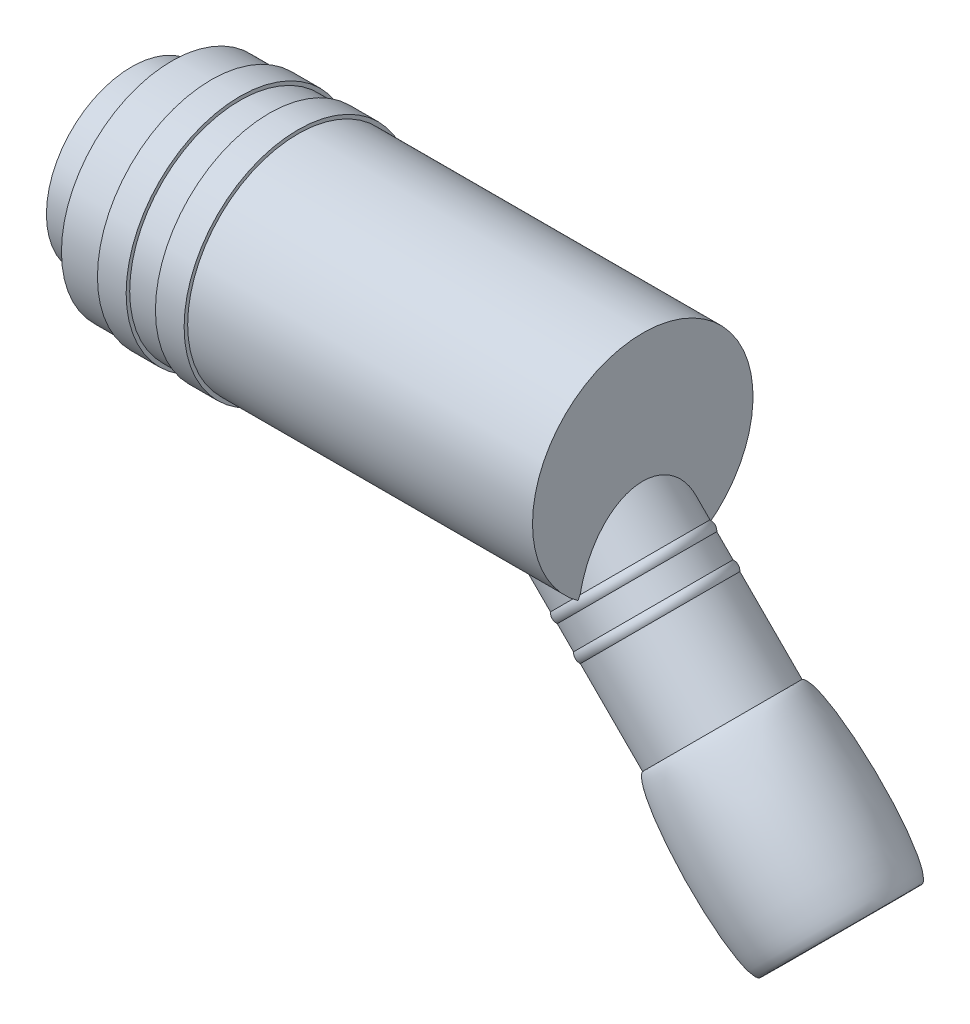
ISO-10303-21;
HEADER;
FILE_DESCRIPTION(('STEP AP214'),'2;1');
FILE_NAME('part.step','',(''),(''),'','','');
FILE_SCHEMA(('AUTOMOTIVE_DESIGN { 1 0 10303 214 1 1 1 1 }'));
ENDSEC;
DATA;
#1=APPLICATION_CONTEXT('core data for automotive mechanical design processes');
#2=APPLICATION_PROTOCOL_DEFINITION('international standard','automotive_design',2000,#1);
#3=PRODUCT_CONTEXT('',#1,'mechanical');
#4=PRODUCT('Part','Part','',(#3));
#5=PRODUCT_RELATED_PRODUCT_CATEGORY('part','',(#4));
#6=PRODUCT_DEFINITION_FORMATION('','',#4);
#7=PRODUCT_DEFINITION_CONTEXT('part definition',#1,'design');
#8=PRODUCT_DEFINITION('design','',#6,#7);
#9=PRODUCT_DEFINITION_SHAPE('','',#8);
#10=(LENGTH_UNIT() NAMED_UNIT(*) SI_UNIT(.MILLI.,.METRE.));
#11=(NAMED_UNIT(*) PLANE_ANGLE_UNIT() SI_UNIT($,.RADIAN.));
#12=(NAMED_UNIT(*) SI_UNIT($,.STERADIAN.) SOLID_ANGLE_UNIT());
#13=UNCERTAINTY_MEASURE_WITH_UNIT(LENGTH_MEASURE(1.E-05),#10,'distance_accuracy_value','');
#14=(GEOMETRIC_REPRESENTATION_CONTEXT(3) GLOBAL_UNCERTAINTY_ASSIGNED_CONTEXT((#13)) GLOBAL_UNIT_ASSIGNED_CONTEXT((#10,
#11,#12)) REPRESENTATION_CONTEXT('',''));
#15=CARTESIAN_POINT('',(0.,0.,0.));
#16=DIRECTION('',(0.,0.,1.));
#17=DIRECTION('',(1.,0.,0.));
#18=AXIS2_PLACEMENT_3D('',#15,#16,#17);
#19=CARTESIAN_POINT('',(47.3819180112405,0.,0.));
#20=DIRECTION('',(1.,0.,0.));
#21=DIRECTION('',(0.,0.,-1.));
#22=AXIS2_PLACEMENT_3D('',#19,#20,#21);
#23=PLANE('',#22);
#24=CARTESIAN_POINT('',(47.3819180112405,0.,0.));
#25=DIRECTION('',(-1.,0.,0.));
#26=DIRECTION('',(0.,0.,1.));
#27=AXIS2_PLACEMENT_3D('',#24,#25,#26);
#28=CIRCLE('',#27,6.5);
#29=CARTESIAN_POINT('',(47.3819180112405,-4.98680977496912,-4.16913999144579));
#30=VERTEX_POINT('',#29);
#31=CARTESIAN_POINT('',(47.3819180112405,-5.09493510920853,-4.0362899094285));
#32=VERTEX_POINT('',#31);
#33=EDGE_CURVE('E298',#30,#32,#28,.T.);
#34=ORIENTED_EDGE('',*,*,#33,.T.);
#35=CARTESIAN_POINT('',(47.3819180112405,-7.37383428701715,0.));
#36=DIRECTION('',(1.,0.,0.));
#37=DIRECTION('',(0.,-1.,0.));
#38=AXIS2_PLACEMENT_3D('',#35,#36,#37);
#39=ELLIPSE('',#38,6.14718665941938,4.34596717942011);
#40=CARTESIAN_POINT('',(47.3819180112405,-5.09493510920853,4.0362899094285));
#41=VERTEX_POINT('',#40);
#42=EDGE_CURVE('E35',#32,#41,#39,.T.);
#43=ORIENTED_EDGE('',*,*,#42,.T.);
#44=CARTESIAN_POINT('',(47.3819180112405,-4.98680977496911,4.16913999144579));
#45=VERTEX_POINT('',#44);
#46=EDGE_CURVE('E300',#41,#45,#28,.T.);
#47=ORIENTED_EDGE('',*,*,#46,.T.);
#48=CARTESIAN_POINT('',(47.3819180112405,-7.38191801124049,0.));
#49=DIRECTION('',(1.,0.,0.));
#50=DIRECTION('',(0.,1.,0.));
#51=AXIS2_PLACEMENT_3D('',#48,#49,#50);
#52=ELLIPSE('',#51,6.36396103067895,4.5);
#53=EDGE_CURVE('E135',#45,#30,#52,.F.);
#54=ORIENTED_EDGE('',*,*,#53,.T.);
#55=EDGE_LOOP('',(#34,#43,#47,#54));
#56=FACE_BOUND('',#55,.T.);
#57=ADVANCED_FACE('F15',(#56),#23,.F.);
#58=DIRECTION('',(0.,0.,1.));
#59=VECTOR('',#58,1.);
#60=CARTESIAN_POINT('',(47.3819180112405,-0.266580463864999,0.));
#61=LINE('',#60,#59);
#62=CARTESIAN_POINT('',(47.3819180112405,-0.266580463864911,-4.11533544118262));
#63=VERTEX_POINT('',#62);
#64=CARTESIAN_POINT('',(47.3819180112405,-0.266580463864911,4.11533544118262));
#65=VERTEX_POINT('',#64);
#66=EDGE_CURVE('E124',#63,#65,#61,.T.);
#67=ORIENTED_EDGE('',*,*,#66,.T.);
#68=CARTESIAN_POINT('',(47.3819180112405,-7.38191801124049,0.));
#69=DIRECTION('',(1.,0.,0.));
#70=DIRECTION('',(0.,1.,0.));
#71=AXIS2_PLACEMENT_3D('',#68,#69,#70);
#72=ELLIPSE('',#71,9.19238815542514,6.5);
#73=CARTESIAN_POINT('',(47.3819180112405,-3.05769055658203,5.73589822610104));
#74=VERTEX_POINT('',#73);
#75=EDGE_CURVE('E179',#65,#74,#72,.T.);
#76=ORIENTED_EDGE('',*,*,#75,.T.);
#77=CARTESIAN_POINT('',(47.3819180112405,-3.05769055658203,-5.73589822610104));
#78=VERTEX_POINT('',#77);
#79=EDGE_CURVE('E301',#74,#78,#28,.T.);
#80=ORIENTED_EDGE('',*,*,#79,.T.);
#81=EDGE_CURVE('E177',#78,#63,#72,.T.);
#82=ORIENTED_EDGE('',*,*,#81,.T.);
#83=EDGE_LOOP('',(#67,#76,#80,#82));
#84=FACE_BOUND('',#83,.T.);
#85=ADVANCED_FACE('F17',(#84),#23,.F.);
#86=CARTESIAN_POINT('',(0.,0.,0.));
#87=DIRECTION('',(-1.,0.,0.));
#88=DIRECTION('',(0.,0.,1.));
#89=AXIS2_PLACEMENT_3D('',#86,#87,#88);
#90=CYLINDRICAL_SURFACE('',#89,6.5);
#91=ORIENTED_EDGE('',*,*,#46,.F.);
#92=CARTESIAN_POINT('',(47.3819180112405,-5.09493510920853,4.0362899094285));
#93=CARTESIAN_POINT('',(47.2554331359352,-5.07182477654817,4.06546004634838));
#94=CARTESIAN_POINT('',(47.1283310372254,-5.04974245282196,4.09282062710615));
#95=CARTESIAN_POINT('',(46.8729282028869,-5.00801809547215,4.14377167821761));
#96=CARTESIAN_POINT('',(46.744627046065,-4.9883769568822,4.16736076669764));
#97=CARTESIAN_POINT('',(46.4858599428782,-4.95178191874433,4.21077993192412));
#98=CARTESIAN_POINT('',(46.3553848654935,-4.93485226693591,4.23057637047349));
#99=CARTESIAN_POINT('',(46.0934718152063,-4.90436036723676,4.26588729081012));
#100=CARTESIAN_POINT('',(45.96203393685,-4.890797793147,4.28140218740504));
#101=CARTESIAN_POINT('',(45.6946238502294,-4.8672472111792,4.30815880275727));
#102=CARTESIAN_POINT('',(45.5586282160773,-4.85737066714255,4.31926782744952));
#103=CARTESIAN_POINT('',(45.2860430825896,-4.84239999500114,4.33604551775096));
#104=CARTESIAN_POINT('',(45.149453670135,-4.83730518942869,4.34171495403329));
#105=CARTESIAN_POINT('',(44.876495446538,-4.83262003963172,4.34692970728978));
#106=CARTESIAN_POINT('',(44.7401273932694,-4.83301159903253,4.34649515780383));
#107=CARTESIAN_POINT('',(44.4677784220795,-4.83999047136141,4.33872394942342));
#108=CARTESIAN_POINT('',(44.3317973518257,-4.846574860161,4.33139054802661));
#109=CARTESIAN_POINT('',(44.0822027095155,-4.86504839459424,4.31062199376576));
#110=CARTESIAN_POINT('',(43.9684225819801,-4.87594481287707,4.29832282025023));
#111=CARTESIAN_POINT('',(43.7423002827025,-4.90295315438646,4.26749030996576));
#112=CARTESIAN_POINT('',(43.6299582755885,-4.91906566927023,4.24895626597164));
#113=CARTESIAN_POINT('',(43.4083090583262,-4.95654844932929,4.20516969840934));
#114=CARTESIAN_POINT('',(43.2989860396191,-4.97788085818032,4.17996544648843));
#115=CARTESIAN_POINT('',(43.0834679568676,-5.02581261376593,4.12220998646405));
#116=CARTESIAN_POINT('',(42.9772727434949,-5.05241170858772,4.08965912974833));
#117=CARTESIAN_POINT('',(42.7678745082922,-5.11086433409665,4.01637690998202));
#118=CARTESIAN_POINT('',(42.6647149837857,-5.14277043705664,3.97556270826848));
#119=CARTESIAN_POINT('',(42.4635585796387,-5.2109955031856,3.88570505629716));
#120=CARTESIAN_POINT('',(42.365561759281,-5.24731451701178,3.83666151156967));
#121=CARTESIAN_POINT('',(42.1754438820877,-5.32350657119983,3.73022302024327));
#122=CARTESIAN_POINT('',(42.0833324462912,-5.36338518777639,3.67281487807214));
#123=CARTESIAN_POINT('',(41.9058301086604,-5.44552263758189,3.54989317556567));
#124=CARTESIAN_POINT('',(41.8204390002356,-5.48778139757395,3.48437986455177));
#125=CARTESIAN_POINT('',(41.6640522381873,-5.56967256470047,3.35175674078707));
#126=CARTESIAN_POINT('',(41.5924512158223,-5.60920764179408,3.28529801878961));
#127=CARTESIAN_POINT('',(41.455371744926,-5.68832724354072,3.14631962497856));
#128=CARTESIAN_POINT('',(41.389895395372,-5.72791178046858,3.07379789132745));
#129=CARTESIAN_POINT('',(41.2651945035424,-5.80621851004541,2.92318788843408));
#130=CARTESIAN_POINT('',(41.2059678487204,-5.84494099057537,2.84510151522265));
#131=CARTESIAN_POINT('',(41.0937157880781,-5.92074216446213,2.6837952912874));
#132=CARTESIAN_POINT('',(41.0406927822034,-5.95782021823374,2.60057347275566));
#133=CARTESIAN_POINT('',(40.9380556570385,-6.03158012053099,2.4247927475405));
#134=CARTESIAN_POINT('',(40.8887925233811,-6.06812651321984,2.33197199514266));
#135=CARTESIAN_POINT('',(40.797034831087,-6.13783568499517,2.14178334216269));
#136=CARTESIAN_POINT('',(40.7545427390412,-6.17099722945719,2.04441380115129));
#137=CARTESIAN_POINT('',(40.6762463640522,-6.23329309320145,1.84577663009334));
#138=CARTESIAN_POINT('',(40.640442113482,-6.26242739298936,1.7445089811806));
#139=CARTESIAN_POINT('',(40.5754251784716,-6.31614711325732,1.53870033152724));
#140=CARTESIAN_POINT('',(40.5462129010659,-6.34073225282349,1.43415912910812));
#141=CARTESIAN_POINT('',(40.4924045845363,-6.38654383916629,1.21470952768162));
#142=CARTESIAN_POINT('',(40.4683010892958,-6.40739417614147,1.09960136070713));
#143=CARTESIAN_POINT('',(40.427512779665,-6.44297214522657,0.86714351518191));
#144=CARTESIAN_POINT('',(40.4108283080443,-6.45769949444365,0.749793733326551));
#145=CARTESIAN_POINT('',(40.3848223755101,-6.48076016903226,0.513638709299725));
#146=CARTESIAN_POINT('',(40.3755021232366,-6.48909244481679,0.394833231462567));
#147=CARTESIAN_POINT('',(40.3641991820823,-6.49920703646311,0.156598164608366));
#148=CARTESIAN_POINT('',(40.362216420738,-6.50098941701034,0.0371685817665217));
#149=CARTESIAN_POINT('',(40.3656169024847,-6.49794044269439,-0.203987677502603));
#150=CARTESIAN_POINT('',(40.3711541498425,-6.49297081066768,-0.325710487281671));
#151=CARTESIAN_POINT('',(40.3898830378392,-6.47626909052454,-0.568054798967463));
#152=CARTESIAN_POINT('',(40.4030719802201,-6.46453938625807,-0.688676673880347));
#153=CARTESIAN_POINT('',(40.437154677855,-6.4345365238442,-0.928060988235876));
#154=CARTESIAN_POINT('',(40.4580519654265,-6.41626036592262,-1.04682254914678));
#155=CARTESIAN_POINT('',(40.5076123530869,-6.37353078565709,-1.28153358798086));
#156=CARTESIAN_POINT('',(40.536272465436,-6.34907974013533,-1.39748412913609));
#157=CARTESIAN_POINT('',(40.6014703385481,-6.29448114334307,-1.62582005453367));
#158=CARTESIAN_POINT('',(40.6380107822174,-6.26433165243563,-1.73820420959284));
#159=CARTESIAN_POINT('',(40.7190679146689,-6.1989912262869,-1.95849469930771));
#160=CARTESIAN_POINT('',(40.7635815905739,-6.16380219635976,-2.06640270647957));
#161=CARTESIAN_POINT('',(40.8607412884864,-6.08915078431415,-2.27699956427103));
#162=CARTESIAN_POINT('',(40.913389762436,-6.04968711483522,-2.37968682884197));
#163=CARTESIAN_POINT('',(41.0269344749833,-5.96744371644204,-2.57899914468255));
#164=CARTESIAN_POINT('',(41.0878304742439,-5.92466408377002,-2.67562437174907));
#165=CARTESIAN_POINT('',(41.2163532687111,-5.83798141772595,-2.85973263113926));
#166=CARTESIAN_POINT('',(41.2837774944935,-5.7941319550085,-2.94738215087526));
#167=CARTESIAN_POINT('',(41.4265454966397,-5.70551436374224,-3.1154665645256));
#168=CARTESIAN_POINT('',(41.5018884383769,-5.66074633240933,-3.19590221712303));
#169=CARTESIAN_POINT('',(41.6602739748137,-5.57162157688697,-3.34885989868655));
#170=CARTESIAN_POINT('',(41.7433084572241,-5.52726447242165,-3.42139009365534));
#171=CARTESIAN_POINT('',(41.9167997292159,-5.44025568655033,-3.55811573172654));
#172=CARTESIAN_POINT('',(42.0072557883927,-5.39760383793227,-3.62231199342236));
#173=CARTESIAN_POINT('',(42.1871751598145,-5.3187349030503,-3.7370439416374));
#174=CARTESIAN_POINT('',(42.2760926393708,-5.28227779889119,-3.78827228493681));
#175=CARTESIAN_POINT('',(42.4590824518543,-5.21275729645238,-3.88337932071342));
#176=CARTESIAN_POINT('',(42.553156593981,-5.1796951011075,-3.92725541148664));
#177=CARTESIAN_POINT('',(42.7455895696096,-5.11771079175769,-4.00769461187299));
#178=CARTESIAN_POINT('',(42.8439449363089,-5.08878540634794,-4.04426350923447));
#179=CARTESIAN_POINT('',(43.0441444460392,-5.03552053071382,-4.11039339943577));
#180=CARTESIAN_POINT('',(43.1459877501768,-5.01117994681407,-4.1399560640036));
#181=CARTESIAN_POINT('',(43.3774481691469,-4.96197500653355,-4.19888406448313));
#182=CARTESIAN_POINT('',(43.5078014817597,-4.93842018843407,-4.22645641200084));
#183=CARTESIAN_POINT('',(43.7712183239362,-4.89871636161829,-4.27241083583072));
#184=CARTESIAN_POINT('',(43.904282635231,-4.88256952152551,-4.29079022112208));
#185=CARTESIAN_POINT('',(44.1728477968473,-4.85718606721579,-4.3195036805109));
#186=CARTESIAN_POINT('',(44.308359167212,-4.84799842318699,-4.32978076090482));
#187=CARTESIAN_POINT('',(44.5799742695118,-4.83608202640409,-4.34308415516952));
#188=CARTESIAN_POINT('',(44.7160779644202,-4.83335287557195,-4.34611091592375));
#189=CARTESIAN_POINT('',(45.0688499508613,-4.83370589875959,-4.34572423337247));
#190=CARTESIAN_POINT('',(45.2855121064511,-4.84118495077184,-4.33743730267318));
#191=CARTESIAN_POINT('',(45.7173271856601,-4.8678092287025,-4.30752839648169));
#192=CARTESIAN_POINT('',(45.9324778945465,-4.88696896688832,-4.28588983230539));
#193=CARTESIAN_POINT('',(46.3553136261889,-4.93393486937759,-4.23173006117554));
#194=CARTESIAN_POINT('',(46.5630563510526,-4.96153127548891,-4.19947154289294));
#195=CARTESIAN_POINT('',(46.8721878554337,-5.00804843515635,-4.14367385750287));
#196=CARTESIAN_POINT('',(46.9746705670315,-5.02438043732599,-4.12387382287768));
#197=CARTESIAN_POINT('',(47.1788706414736,-5.05856467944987,-4.08186915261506));
#198=CARTESIAN_POINT('',(47.2805881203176,-5.0764166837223,-4.0596648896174));
#199=CARTESIAN_POINT('',(47.3819180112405,-5.09493510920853,-4.0362899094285));
#200=B_SPLINE_CURVE_WITH_KNOTS('',3,(#92,#93,#94,#95,#96,#97,#98,#99,#100,#101,#102,#103,#104,
#105,#106,#107,#108,#109,#110,#111,#112,#113,#114,#115,#116,#117,#118,#119,#120,#121,#122,#123,
#124,#125,#126,#127,#128,#129,#130,#131,#132,#133,#134,#135,#136,#137,#138,#139,#140,#141,#142,
#143,#144,#145,#146,#147,#148,#149,#150,#151,#152,#153,#154,#155,#156,#157,#158,#159,#160,#161,
#162,#163,#164,#165,#166,#167,#168,#169,#170,#171,#172,#173,#174,#175,#176,#177,#178,#179,#180,
#181,#182,#183,#184,#185,#186,#187,#188,#189,#190,#191,#192,#193,#194,#195,#196,#197,#198,#199),
.UNSPECIFIED.,.F.,.F.,(4,2,2,2,2,2,2,2,2,2,2,2,2,2,2,2,2,2,2,2,2,2,2,2,2,2,2,2,2,2,2,2,2,2,2,2,
2,2,2,2,2,2,2,2,2,2,2,2,2,2,2,2,2,4),(0.,0.39553765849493,0.791219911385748,1.19026377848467,
1.58926897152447,1.99951466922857,2.40970223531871,2.81853714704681,3.2271791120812,
3.57179836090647,3.91645671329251,4.25868595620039,4.60089883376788,4.94672924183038,
5.29256362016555,5.6389495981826,5.98532492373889,6.30113321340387,6.61704933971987,
6.93285833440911,7.24878910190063,7.58220191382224,7.91573590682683,8.24927151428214,
8.58282771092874,8.94072923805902,9.29864729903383,9.65662409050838,10.0145973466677,
10.3800132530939,10.7453003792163,11.110755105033,11.4760693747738,11.8415082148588,
12.2068092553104,12.5722206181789,12.9376213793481,13.2940280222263,13.6503971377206,
14.0063945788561,14.36235702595,14.6886459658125,15.0150501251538,15.3411947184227,
15.6672614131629,16.0725486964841,16.4779545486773,16.8861873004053,17.2943948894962,
17.9442660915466,18.5949463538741,19.2306094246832,19.5475198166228,19.8643811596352),.UNSPECIFIED.);
#201=EDGE_CURVE('E110',#41,#32,#200,.T.);
#202=ORIENTED_EDGE('',*,*,#201,.T.);
#203=ORIENTED_EDGE('',*,*,#33,.F.);
#204=CARTESIAN_POINT('',(47.3819180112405,-4.98680977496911,-4.16913999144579));
#205=CARTESIAN_POINT('',(47.2712076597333,-4.9653765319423,-4.19477634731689));
#206=CARTESIAN_POINT('',(47.1600430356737,-4.94470065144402,-4.21910582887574));
#207=CARTESIAN_POINT('',(46.9368245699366,-4.90510901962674,-4.26507058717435));
#208=CARTESIAN_POINT('',(46.8247705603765,-4.88619360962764,-4.28670534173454));
#209=CARTESIAN_POINT('',(46.5993606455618,-4.85030119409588,-4.32727567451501));
#210=CARTESIAN_POINT('',(46.4860012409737,-4.83333271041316,-4.34619947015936));
#211=CARTESIAN_POINT('',(46.2585159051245,-4.80172642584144,-4.38109309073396));
#212=CARTESIAN_POINT('',(46.1443900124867,-4.78708850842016,-4.39706306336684));
#213=CARTESIAN_POINT('',(45.7943849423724,-4.74638727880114,-4.44110867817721));
#214=CARTESIAN_POINT('',(45.5573203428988,-4.72460164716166,-4.46413743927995));
#215=CARTESIAN_POINT('',(45.0815441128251,-4.69571816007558,-4.49452175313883));
#216=CARTESIAN_POINT('',(44.8428362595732,-4.6885936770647,-4.50190572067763));
#217=CARTESIAN_POINT('',(44.4707140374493,-4.6920584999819,-4.49828402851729));
#218=CARTESIAN_POINT('',(44.337167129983,-4.69623492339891,-4.49393831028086));
#219=CARTESIAN_POINT('',(44.0707845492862,-4.71118044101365,-4.4782707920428));
#220=CARTESIAN_POINT('',(43.9379490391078,-4.72195098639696,-4.46694745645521));
#221=CARTESIAN_POINT('',(43.6752025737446,-4.75056838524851,-4.43650001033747));
#222=CARTESIAN_POINT('',(43.5452758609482,-4.7683476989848,-4.41745030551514));
#223=CARTESIAN_POINT('',(43.2883167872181,-4.81134624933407,-4.37057927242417));
#224=CARTESIAN_POINT('',(43.1612821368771,-4.83655936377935,-4.3427651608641));
#225=CARTESIAN_POINT('',(42.9781321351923,-4.87894996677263,-4.29491020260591));
#226=CARTESIAN_POINT('',(42.9203355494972,-4.89323902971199,-4.27863792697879));
#227=CARTESIAN_POINT('',(42.8056687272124,-4.92341572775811,-4.24387868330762));
#228=CARTESIAN_POINT('',(42.7488011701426,-4.93930727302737,-4.2253862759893));
#229=CARTESIAN_POINT('',(42.6925386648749,-4.95595981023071,-4.20576537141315));
#230=B_SPLINE_CURVE_WITH_KNOTS('',3,(#204,#205,#206,#207,#208,#209,#210,#211,#212,#213,#214,
#215,#216,#217,#218,#219,#220,#221,#222,#223,#224,#225,#226,#227,#228,#229),.UNSPECIFIED.,.F.,
.F.,(4,2,2,2,2,2,2,2,2,2,2,2,4),(0.,0.346925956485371,0.69391903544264,1.04237724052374,
1.39081801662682,2.10756291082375,2.82300490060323,3.22377022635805,3.62462378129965,
4.02170541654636,4.41846094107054,4.60356382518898,4.78912983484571),.UNSPECIFIED.);
#231=CARTESIAN_POINT('',(42.6925386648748,-4.95595981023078,-4.20576537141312));
#232=VERTEX_POINT('',#231);
#233=EDGE_CURVE('E130',#30,#232,#230,.T.);
#234=ORIENTED_EDGE('',*,*,#233,.T.);
#235=CARTESIAN_POINT('',(47.6484984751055,0.,0.));
#236=DIRECTION('',(-0.707106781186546,0.707106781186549,0.));
#237=DIRECTION('',(-0.707106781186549,-0.707106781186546,0.));
#238=AXIS2_PLACEMENT_3D('',#235,#236,#237);
#239=ELLIPSE('',#238,9.19238815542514,6.5);
#240=CARTESIAN_POINT('',(45.408305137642,-2.2401933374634,-6.10176481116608));
#241=VERTEX_POINT('',#240);
#242=EDGE_CURVE('E29',#232,#241,#239,.F.);
#243=ORIENTED_EDGE('',*,*,#242,.T.);
#244=CARTESIAN_POINT('',(40.,0.,0.));
#245=DIRECTION('',(-0.382683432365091,-0.923879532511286,0.));
#246=DIRECTION('',(-0.923879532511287,0.382683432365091,0.));
#247=AXIS2_PLACEMENT_3D('',#244,#245,#246);
#248=ELLIPSE('',#247,16.9853185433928,6.5);
#249=EDGE_CURVE('E178',#241,#78,#248,.T.);
#250=ORIENTED_EDGE('',*,*,#249,.T.);
#251=ORIENTED_EDGE('',*,*,#79,.F.);
#252=CARTESIAN_POINT('',(45.408305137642,-2.2401933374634,6.10176481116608));
#253=VERTEX_POINT('',#252);
#254=EDGE_CURVE('E183',#74,#253,#248,.T.);
#255=ORIENTED_EDGE('',*,*,#254,.T.);
#256=CARTESIAN_POINT('',(42.6925386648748,-4.95595981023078,4.20576537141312));
#257=VERTEX_POINT('',#256);
#258=EDGE_CURVE('E358',#253,#257,#239,.F.);
#259=ORIENTED_EDGE('',*,*,#258,.T.);
#260=CARTESIAN_POINT('',(42.6925386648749,-4.95595981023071,4.20576537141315));
#261=CARTESIAN_POINT('',(42.7566753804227,-4.93697449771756,4.22813334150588));
#262=CARTESIAN_POINT('',(42.821598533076,-4.91898145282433,4.24903325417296));
#263=CARTESIAN_POINT('',(42.9527936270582,-4.885047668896,4.28800446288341));
#264=CARTESIAN_POINT('',(43.019065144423,-4.86910629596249,4.30607663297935));
#265=CARTESIAN_POINT('',(43.2192309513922,-4.82453266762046,4.35613306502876));
#266=CARTESIAN_POINT('',(43.3548584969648,-4.79903784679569,4.38408822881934));
#267=CARTESIAN_POINT('',(43.6270175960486,-4.75671539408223,4.42996761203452));
#268=CARTESIAN_POINT('',(43.7635085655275,-4.73976916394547,4.44802940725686));
#269=CARTESIAN_POINT('',(44.0381296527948,-4.71347939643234,4.47587621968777));
#270=CARTESIAN_POINT('',(44.1762609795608,-4.70414187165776,4.48565469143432));
#271=CARTESIAN_POINT('',(44.5206200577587,-4.68948679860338,4.50098990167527));
#272=CARTESIAN_POINT('',(44.7272185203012,-4.68834781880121,4.50216493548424));
#273=CARTESIAN_POINT('',(45.1397307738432,-4.69862136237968,4.49143331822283));
#274=CARTESIAN_POINT('',(45.3456441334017,-4.7100406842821,4.47951958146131));
#275=CARTESIAN_POINT('',(45.7570492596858,-4.74303396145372,4.44457027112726));
#276=CARTESIAN_POINT('',(45.9625289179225,-4.76467556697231,4.42146057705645));
#277=CARTESIAN_POINT('',(46.3710288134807,-4.81599250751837,4.36550700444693));
#278=CARTESIAN_POINT('',(46.5740499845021,-4.84566468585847,4.33266695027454));
#279=CARTESIAN_POINT('',(46.8777370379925,-4.89510489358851,4.2765148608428));
#280=CARTESIAN_POINT('',(46.9794198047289,-4.91252406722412,4.25651064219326));
#281=CARTESIAN_POINT('',(47.1814935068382,-4.94869681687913,4.21439974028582));
#282=CARTESIAN_POINT('',(47.2818884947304,-4.96744230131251,4.19230556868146));
#283=CARTESIAN_POINT('',(47.3819180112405,-4.98680977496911,4.16913999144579));
#284=B_SPLINE_CURVE_WITH_KNOTS('',3,(#260,#261,#262,#263,#264,#265,#266,#267,#268,#269,#270,
#271,#272,#273,#274,#275,#276,#277,#278,#279,#280,#281,#282,#283),.UNSPECIFIED.,.F.,.F.,(4,2,2,
2,2,2,2,2,2,2,2,4),(0.,0.211528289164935,0.422991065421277,0.844664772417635,1.26031540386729,
1.6762941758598,2.29505336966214,2.91414769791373,3.53739780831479,4.16040328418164,
4.47563039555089,4.78907726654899),.UNSPECIFIED.);
#285=EDGE_CURVE('E167',#257,#45,#284,.T.);
#286=ORIENTED_EDGE('',*,*,#285,.T.);
#287=EDGE_LOOP('',(#91,#202,#203,#234,#243,#250,#251,#255,#259,#286));
#288=FACE_BOUND('',#287,.T.);
#289=CARTESIAN_POINT('',(0.,0.,0.));
#290=DIRECTION('',(-1.,0.,0.));
#291=DIRECTION('',(0.,0.,1.));
#292=AXIS2_PLACEMENT_3D('',#289,#290,#291);
#293=CIRCLE('',#292,6.5);
#294=CARTESIAN_POINT('',(0.,0.,6.5));
#295=VERTEX_POINT('',#294);
#296=EDGE_CURVE('E305',#295,#295,#293,.T.);
#297=ORIENTED_EDGE('',*,*,#296,.T.);
#298=EDGE_LOOP('',(#297));
#299=FACE_BOUND('',#298,.T.);
#300=ADVANCED_FACE('F144',(#288,#299),#90,.F.);
#301=CARTESIAN_POINT('',(0.,6.5,0.));
#302=DIRECTION('',(1.,0.,0.));
#303=DIRECTION('',(0.,0.,-1.));
#304=AXIS2_PLACEMENT_3D('',#301,#302,#303);
#305=PLANE('',#304);
#306=ORIENTED_EDGE('',*,*,#296,.F.);
#307=EDGE_LOOP('',(#306));
#308=FACE_BOUND('',#307,.T.);
#309=CARTESIAN_POINT('',(0.,0.,0.));
#310=DIRECTION('',(-1.,0.,0.));
#311=DIRECTION('',(0.,0.,1.));
#312=AXIS2_PLACEMENT_3D('',#309,#310,#311);
#313=CIRCLE('',#312,8.5);
#314=CARTESIAN_POINT('',(0.,0.,8.5));
#315=VERTEX_POINT('',#314);
#316=EDGE_CURVE('E307',#315,#315,#313,.T.);
#317=ORIENTED_EDGE('',*,*,#316,.T.);
#318=EDGE_LOOP('',(#317));
#319=FACE_BOUND('',#318,.T.);
#320=ADVANCED_FACE('F419',(#308,#319),#305,.F.);
#321=CARTESIAN_POINT('',(0.,0.,0.));
#322=DIRECTION('',(-1.,0.,0.));
#323=DIRECTION('',(0.,0.,1.));
#324=AXIS2_PLACEMENT_3D('',#321,#322,#323);
#325=CYLINDRICAL_SURFACE('',#324,8.5);
#326=ORIENTED_EDGE('',*,*,#316,.F.);
#327=EDGE_LOOP('',(#326));
#328=FACE_BOUND('',#327,.T.);
#329=CARTESIAN_POINT('',(4.,0.,0.));
#330=DIRECTION('',(-1.,0.,0.));
#331=DIRECTION('',(0.,0.,1.));
#332=AXIS2_PLACEMENT_3D('',#329,#330,#331);
#333=CIRCLE('',#332,8.5);
#334=CARTESIAN_POINT('',(4.,0.,8.5));
#335=VERTEX_POINT('',#334);
#336=EDGE_CURVE('E311',#335,#335,#333,.T.);
#337=ORIENTED_EDGE('',*,*,#336,.T.);
#338=EDGE_LOOP('',(#337));
#339=FACE_BOUND('',#338,.T.);
#340=ADVANCED_FACE('F526',(#328,#339),#325,.T.);
#341=CARTESIAN_POINT('',(4.,8.5,0.));
#342=DIRECTION('',(1.,0.,0.));
#343=DIRECTION('',(0.,0.,-1.));
#344=AXIS2_PLACEMENT_3D('',#341,#342,#343);
#345=PLANE('',#344);
#346=ORIENTED_EDGE('',*,*,#336,.F.);
#347=EDGE_LOOP('',(#346));
#348=FACE_BOUND('',#347,.T.);
#349=CARTESIAN_POINT('',(4.,0.,0.));
#350=DIRECTION('',(-1.,0.,0.));
#351=DIRECTION('',(0.,0.,1.));
#352=AXIS2_PLACEMENT_3D('',#349,#350,#351);
#353=CIRCLE('',#352,11.);
#354=CARTESIAN_POINT('',(4.,0.,11.));
#355=VERTEX_POINT('',#354);
#356=EDGE_CURVE('E316',#355,#355,#353,.T.);
#357=ORIENTED_EDGE('',*,*,#356,.T.);
#358=EDGE_LOOP('',(#357));
#359=FACE_BOUND('',#358,.T.);
#360=ADVANCED_FACE('F516',(#348,#359),#345,.F.);
#361=CARTESIAN_POINT('',(0.,0.,0.));
#362=DIRECTION('',(-1.,0.,0.));
#363=DIRECTION('',(0.,0.,1.));
#364=AXIS2_PLACEMENT_3D('',#361,#362,#363);
#365=CYLINDRICAL_SURFACE('',#364,11.);
#366=ORIENTED_EDGE('',*,*,#356,.F.);
#367=EDGE_LOOP('',(#366));
#368=FACE_BOUND('',#367,.T.);
#369=CARTESIAN_POINT('',(7.94623983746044,0.,0.));
#370=DIRECTION('',(-1.,0.,0.));
#371=DIRECTION('',(0.,0.,1.));
#372=AXIS2_PLACEMENT_3D('',#369,#370,#371);
#373=CIRCLE('',#372,11.);
#374=CARTESIAN_POINT('',(7.94623983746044,0.,11.));
#375=VERTEX_POINT('',#374);
#376=EDGE_CURVE('E319',#375,#375,#373,.T.);
#377=ORIENTED_EDGE('',*,*,#376,.T.);
#378=EDGE_LOOP('',(#377));
#379=FACE_BOUND('',#378,.T.);
#380=ADVANCED_FACE('F506',(#368,#379),#365,.T.);
#381=CARTESIAN_POINT('',(7.94623983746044,11.,0.));
#382=DIRECTION('',(1.,0.,0.));
#383=DIRECTION('',(0.,0.,-1.));
#384=AXIS2_PLACEMENT_3D('',#381,#382,#383);
#385=PLANE('',#384);
#386=ORIENTED_EDGE('',*,*,#376,.F.);
#387=EDGE_LOOP('',(#386));
#388=FACE_BOUND('',#387,.T.);
#389=CARTESIAN_POINT('',(7.94623983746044,0.,0.));
#390=DIRECTION('',(-1.,0.,0.));
#391=DIRECTION('',(0.,0.,1.));
#392=AXIS2_PLACEMENT_3D('',#389,#390,#391);
#393=CIRCLE('',#392,11.3537053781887);
#394=CARTESIAN_POINT('',(7.94623983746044,0.,11.3537053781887));
#395=VERTEX_POINT('',#394);
#396=EDGE_CURVE('E322',#395,#395,#393,.T.);
#397=ORIENTED_EDGE('',*,*,#396,.T.);
#398=EDGE_LOOP('',(#397));
#399=FACE_BOUND('',#398,.T.);
#400=ADVANCED_FACE('F496',(#388,#399),#385,.F.);
#401=CARTESIAN_POINT('',(0.,0.,0.));
#402=DIRECTION('',(-1.,0.,0.));
#403=DIRECTION('',(0.,0.,1.));
#404=AXIS2_PLACEMENT_3D('',#401,#402,#403);
#405=CYLINDRICAL_SURFACE('',#404,11.3537053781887);
#406=ORIENTED_EDGE('',*,*,#396,.F.);
#407=EDGE_LOOP('',(#406));
#408=FACE_BOUND('',#407,.T.);
#409=CARTESIAN_POINT('',(10.8087824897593,0.,0.));
#410=DIRECTION('',(-1.,0.,0.));
#411=DIRECTION('',(0.,0.,1.));
#412=AXIS2_PLACEMENT_3D('',#409,#410,#411);
#413=CIRCLE('',#412,11.3537053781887);
#414=CARTESIAN_POINT('',(10.8087824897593,0.,11.3537053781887));
#415=VERTEX_POINT('',#414);
#416=EDGE_CURVE('E325',#415,#415,#413,.T.);
#417=ORIENTED_EDGE('',*,*,#416,.T.);
#418=EDGE_LOOP('',(#417));
#419=FACE_BOUND('',#418,.T.);
#420=ADVANCED_FACE('F486',(#408,#419),#405,.T.);
#421=CARTESIAN_POINT('',(10.8087824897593,11.3537053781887,0.));
#422=DIRECTION('',(-1.,0.,0.));
#423=DIRECTION('',(0.,0.,1.));
#424=AXIS2_PLACEMENT_3D('',#421,#422,#423);
#425=PLANE('',#424);
#426=ORIENTED_EDGE('',*,*,#416,.F.);
#427=EDGE_LOOP('',(#426));
#428=FACE_BOUND('',#427,.T.);
#429=CARTESIAN_POINT('',(10.8087824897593,0.,0.));
#430=DIRECTION('',(-1.,0.,0.));
#431=DIRECTION('',(0.,0.,1.));
#432=AXIS2_PLACEMENT_3D('',#429,#430,#431);
#433=CIRCLE('',#432,11.);
#434=CARTESIAN_POINT('',(10.8087824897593,0.,11.));
#435=VERTEX_POINT('',#434);
#436=EDGE_CURVE('E328',#435,#435,#433,.T.);
#437=ORIENTED_EDGE('',*,*,#436,.T.);
#438=EDGE_LOOP('',(#437));
#439=FACE_BOUND('',#438,.T.);
#440=ADVANCED_FACE('F476',(#428,#439),#425,.F.);
#441=CARTESIAN_POINT('',(0.,0.,0.));
#442=DIRECTION('',(-1.,0.,0.));
#443=DIRECTION('',(0.,0.,1.));
#444=AXIS2_PLACEMENT_3D('',#441,#442,#443);
#445=CYLINDRICAL_SURFACE('',#444,11.);
#446=ORIENTED_EDGE('',*,*,#436,.F.);
#447=EDGE_LOOP('',(#446));
#448=FACE_BOUND('',#447,.T.);
#449=CARTESIAN_POINT('',(13.730938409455,0.,0.));
#450=DIRECTION('',(-1.,0.,0.));
#451=DIRECTION('',(0.,0.,1.));
#452=AXIS2_PLACEMENT_3D('',#449,#450,#451);
#453=CIRCLE('',#452,11.);
#454=CARTESIAN_POINT('',(13.730938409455,0.,11.));
#455=VERTEX_POINT('',#454);
#456=EDGE_CURVE('E331',#455,#455,#453,.T.);
#457=ORIENTED_EDGE('',*,*,#456,.T.);
#458=EDGE_LOOP('',(#457));
#459=FACE_BOUND('',#458,.T.);
#460=ADVANCED_FACE('F466',(#448,#459),#445,.T.);
#461=CARTESIAN_POINT('',(13.730938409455,11.3537053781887,0.));
#462=DIRECTION('',(1.,0.,0.));
#463=DIRECTION('',(0.,0.,-1.));
#464=AXIS2_PLACEMENT_3D('',#461,#462,#463);
#465=PLANE('',#464);
#466=ORIENTED_EDGE('',*,*,#456,.F.);
#467=EDGE_LOOP('',(#466));
#468=FACE_BOUND('',#467,.T.);
#469=CARTESIAN_POINT('',(13.730938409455,0.,0.));
#470=DIRECTION('',(-1.,0.,0.));
#471=DIRECTION('',(0.,0.,1.));
#472=AXIS2_PLACEMENT_3D('',#469,#470,#471);
#473=CIRCLE('',#472,11.3537053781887);
#474=CARTESIAN_POINT('',(13.730938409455,0.,11.3537053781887));
#475=VERTEX_POINT('',#474);
#476=EDGE_CURVE('E334',#475,#475,#473,.T.);
#477=ORIENTED_EDGE('',*,*,#476,.T.);
#478=EDGE_LOOP('',(#477));
#479=FACE_BOUND('',#478,.T.);
#480=ADVANCED_FACE('F455',(#468,#479),#465,.F.);
#481=CARTESIAN_POINT('',(0.,0.,0.));
#482=DIRECTION('',(-1.,0.,0.));
#483=DIRECTION('',(0.,0.,1.));
#484=AXIS2_PLACEMENT_3D('',#481,#482,#483);
#485=CYLINDRICAL_SURFACE('',#484,11.3537053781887);
#486=ORIENTED_EDGE('',*,*,#476,.F.);
#487=EDGE_LOOP('',(#486));
#488=FACE_BOUND('',#487,.T.);
#489=CARTESIAN_POINT('',(16.593481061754,0.,0.));
#490=DIRECTION('',(-1.,0.,0.));
#491=DIRECTION('',(0.,0.,1.));
#492=AXIS2_PLACEMENT_3D('',#489,#490,#491);
#493=CIRCLE('',#492,11.3537053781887);
#494=CARTESIAN_POINT('',(16.593481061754,0.,11.3537053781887));
#495=VERTEX_POINT('',#494);
#496=EDGE_CURVE('E120',#495,#495,#493,.T.);
#497=ORIENTED_EDGE('',*,*,#496,.T.);
#498=EDGE_LOOP('',(#497));
#499=FACE_BOUND('',#498,.T.);
#500=ADVANCED_FACE('F340',(#488,#499),#485,.T.);
#501=CARTESIAN_POINT('',(16.593481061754,11.,0.));
#502=DIRECTION('',(-1.,0.,0.));
#503=DIRECTION('',(0.,0.,1.));
#504=AXIS2_PLACEMENT_3D('',#501,#502,#503);
#505=PLANE('',#504);
#506=ORIENTED_EDGE('',*,*,#496,.F.);
#507=EDGE_LOOP('',(#506));
#508=FACE_BOUND('',#507,.T.);
#509=CARTESIAN_POINT('',(16.593481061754,0.,0.));
#510=DIRECTION('',(-1.,0.,0.));
#511=DIRECTION('',(0.,0.,1.));
#512=AXIS2_PLACEMENT_3D('',#509,#510,#511);
#513=CIRCLE('',#512,11.);
#514=CARTESIAN_POINT('',(16.593481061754,0.,11.));
#515=VERTEX_POINT('',#514);
#516=EDGE_CURVE('E116',#515,#515,#513,.T.);
#517=ORIENTED_EDGE('',*,*,#516,.T.);
#518=EDGE_LOOP('',(#517));
#519=FACE_BOUND('',#518,.T.);
#520=ADVANCED_FACE('F342',(#508,#519),#505,.F.);
#521=CARTESIAN_POINT('',(0.,0.,0.));
#522=DIRECTION('',(-1.,0.,0.));
#523=DIRECTION('',(0.,0.,1.));
#524=AXIS2_PLACEMENT_3D('',#521,#522,#523);
#525=CYLINDRICAL_SURFACE('',#524,11.);
#526=ORIENTED_EDGE('',*,*,#516,.F.);
#527=EDGE_LOOP('',(#526));
#528=FACE_BOUND('',#527,.T.);
#529=CARTESIAN_POINT('',(50.5523893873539,-8.94647836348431,-6.40004100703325));
#530=CARTESIAN_POINT('',(50.4175308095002,-8.93537333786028,-6.41556259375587));
#531=CARTESIAN_POINT('',(50.2823926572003,-8.9254008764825,-6.42941979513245));
#532=CARTESIAN_POINT('',(50.0116145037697,-8.90792406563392,-6.45361251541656));
#533=CARTESIAN_POINT('',(49.8759744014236,-8.90042024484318,-6.46394727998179));
#534=CARTESIAN_POINT('',(49.4677041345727,-8.88188787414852,-6.48941749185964));
#535=CARTESIAN_POINT('',(49.1944894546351,-8.8749037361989,-6.49892858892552));
#536=CARTESIAN_POINT('',(48.6442442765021,-8.87345048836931,-6.50091458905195));
#537=CARTESIAN_POINT('',(48.3672118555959,-8.87915087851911,-6.49315875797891));
#538=CARTESIAN_POINT('',(47.8153395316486,-8.90519247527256,-6.45740614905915));
#539=CARTESIAN_POINT('',(47.5404973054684,-8.9255152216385,-6.4294348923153));
#540=CARTESIAN_POINT('',(47.087563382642,-8.9725727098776,-6.36348396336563));
#541=CARTESIAN_POINT('',(46.9080434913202,-8.99484695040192,-6.33204177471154));
#542=CARTESIAN_POINT('',(46.5523482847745,-9.0465754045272,-6.25791769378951));
#543=CARTESIAN_POINT('',(46.376172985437,-9.07602965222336,-6.21523574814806));
#544=CARTESIAN_POINT('',(46.0293733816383,-9.14186533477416,-6.11798371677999));
#545=CARTESIAN_POINT('',(45.8587265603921,-9.17821296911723,-6.06347145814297));
#546=CARTESIAN_POINT('',(45.5235884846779,-9.25748988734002,-5.94172992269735));
#547=CARTESIAN_POINT('',(45.3590970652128,-9.30041899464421,-5.87450098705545));
#548=CARTESIAN_POINT('',(45.0363871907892,-9.39244807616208,-5.72621972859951));
#549=CARTESIAN_POINT('',(44.8782361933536,-9.44159874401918,-5.64505163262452));
#550=CARTESIAN_POINT('',(44.5712401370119,-9.54455760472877,-5.46916750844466));
#551=CARTESIAN_POINT('',(44.422395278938,-9.59836589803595,-5.37445118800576));
#552=CARTESIAN_POINT('',(44.1351498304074,-9.70917748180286,-5.17157975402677));
#553=CARTESIAN_POINT('',(43.9967616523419,-9.76618443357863,-5.06340906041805));
#554=CARTESIAN_POINT('',(43.7316586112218,-9.88160686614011,-4.8342824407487));
#555=CARTESIAN_POINT('',(43.6049431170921,-9.94002227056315,-4.71332720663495));
#556=CARTESIAN_POINT('',(43.3750787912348,-10.0510737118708,-4.47123855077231));
#557=CARTESIAN_POINT('',(43.270834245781,-10.1037442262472,-4.35115786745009));
#558=CARTESIAN_POINT('',(43.0728591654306,-10.2074848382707,-4.10188737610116));
#559=CARTESIAN_POINT('',(42.9791330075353,-10.2585542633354,-3.97269381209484));
#560=CARTESIAN_POINT('',(42.8024617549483,-10.3578371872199,-3.70613445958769));
#561=CARTESIAN_POINT('',(42.7195151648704,-10.4060510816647,-3.5687698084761));
#562=CARTESIAN_POINT('',(42.5645038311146,-10.4985097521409,-3.28683639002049));
#563=CARTESIAN_POINT('',(42.4924350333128,-10.542756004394,-3.14227033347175));
#564=CARTESIAN_POINT('',(42.3576330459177,-10.6272896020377,-2.84347784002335));
#565=CARTESIAN_POINT('',(42.295150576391,-10.6674634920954,-2.68910619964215));
#566=CARTESIAN_POINT('',(42.1815141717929,-10.7417956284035,-2.37484718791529));
#567=CARTESIAN_POINT('',(42.1303603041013,-10.7759538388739,-2.21495978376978));
#568=CARTESIAN_POINT('',(42.0393222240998,-10.8375462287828,-1.89072101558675));
#569=CARTESIAN_POINT('',(41.9994395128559,-10.864979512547,-1.72636906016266));
#570=CARTESIAN_POINT('',(41.9308973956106,-10.9125636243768,-1.39430633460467));
#571=CARTESIAN_POINT('',(41.9022381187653,-10.932714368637,-1.2265955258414));
#572=CARTESIAN_POINT('',(41.8551621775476,-10.9659978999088,-0.88206466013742));
#573=CARTESIAN_POINT('',(41.8372070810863,-10.978813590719,-0.705150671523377));
#574=CARTESIAN_POINT('',(41.8133633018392,-10.9958638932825,-0.350097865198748));
#575=CARTESIAN_POINT('',(41.8074749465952,-11.0000982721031,-0.171959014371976));
#576=CARTESIAN_POINT('',(41.8077535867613,-10.9998982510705,0.184327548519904));
#577=CARTESIAN_POINT('',(41.8139221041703,-10.9954627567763,0.362475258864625));
#578=CARTESIAN_POINT('',(41.8383297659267,-10.9780124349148,0.717519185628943));
#579=CARTESIAN_POINT('',(41.8565689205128,-10.9649976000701,0.894415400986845));
#580=CARTESIAN_POINT('',(41.9054359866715,-10.9304595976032,1.2477699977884));
#581=CARTESIAN_POINT('',(41.936205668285,-10.9088391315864,1.42419930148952));
#582=CARTESIAN_POINT('',(42.0101898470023,-10.8575651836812,1.77324392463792));
#583=CARTESIAN_POINT('',(42.0534045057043,-10.8279115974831,1.94585919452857));
#584=CARTESIAN_POINT('',(42.1523456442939,-10.7612344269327,2.28601674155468));
#585=CARTESIAN_POINT('',(42.2080726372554,-10.7242105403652,2.45355881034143));
#586=CARTESIAN_POINT('',(42.3320963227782,-10.643655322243,2.78230868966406));
#587=CARTESIAN_POINT('',(42.4003928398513,-10.6001240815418,2.94351658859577));
#588=CARTESIAN_POINT('',(42.5488220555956,-10.5080871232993,3.25675941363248));
#589=CARTESIAN_POINT('',(42.6288268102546,-10.4596367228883,3.40887118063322));
#590=CARTESIAN_POINT('',(42.8011420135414,-10.3586157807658,3.70452201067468));
#591=CARTESIAN_POINT('',(42.8934524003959,-10.3060452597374,3.84806111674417));
#592=CARTESIAN_POINT('',(43.0901997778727,-10.198190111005,4.12541565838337));
#593=CARTESIAN_POINT('',(43.1946328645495,-10.1429063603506,4.25923420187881));
#594=CARTESIAN_POINT('',(43.4153361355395,-10.0311381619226,4.51618189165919));
#595=CARTESIAN_POINT('',(43.5316057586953,-9.97465377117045,4.63931154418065));
#596=CARTESIAN_POINT('',(43.7704773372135,-9.86439044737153,4.86922945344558));
#597=CARTESIAN_POINT('',(43.8926276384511,-9.81059512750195,4.97647937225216));
#598=CARTESIAN_POINT('',(44.1466454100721,-9.7048015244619,5.1797646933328));
#599=CARTESIAN_POINT('',(44.2785124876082,-9.65280316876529,5.27580054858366));
#600=CARTESIAN_POINT('',(44.5508969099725,-9.55199761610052,5.45619026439));
#601=CARTESIAN_POINT('',(44.6914035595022,-9.50318662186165,5.5405581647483));
#602=CARTESIAN_POINT('',(44.9801247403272,-9.40984243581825,5.69765040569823));
#603=CARTESIAN_POINT('',(45.1283392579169,-9.36530923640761,5.77037476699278));
#604=CARTESIAN_POINT('',(45.4276207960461,-9.28243879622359,5.90273521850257));
#605=CARTESIAN_POINT('',(45.578533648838,-9.24397836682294,5.96264386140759));
#606=CARTESIAN_POINT('',(45.8853846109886,-9.17257933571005,6.07190649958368));
#607=CARTESIAN_POINT('',(46.0413227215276,-9.13964073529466,6.1212604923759));
#608=CARTESIAN_POINT('',(46.3577489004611,-9.07948408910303,6.21014213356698));
#609=CARTESIAN_POINT('',(46.5182529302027,-9.05228991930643,6.24962888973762));
#610=CARTESIAN_POINT('',(46.8421439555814,-9.00387586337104,6.31917683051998));
#611=CARTESIAN_POINT('',(47.0055309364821,-8.98265594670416,6.34923806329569));
#612=CARTESIAN_POINT('',(47.4495291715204,-8.93328350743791,6.41867841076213));
#613=CARTESIAN_POINT('',(47.7320744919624,-8.91068884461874,6.44983144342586));
#614=CARTESIAN_POINT('',(48.2997722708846,-8.8811280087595,6.49046426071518));
#615=CARTESIAN_POINT('',(48.584928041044,-8.87418565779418,6.49991100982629));
#616=CARTESIAN_POINT('',(49.1519515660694,-8.87405536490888,6.50008671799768));
#617=CARTESIAN_POINT('',(49.433819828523,-8.88071187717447,6.49102735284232));
#618=CARTESIAN_POINT('',(49.8549441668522,-8.89930843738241,6.4654777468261));
#619=CARTESIAN_POINT('',(49.9948121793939,-8.90692316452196,6.45499461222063));
#620=CARTESIAN_POINT('',(50.2740154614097,-8.92478393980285,6.43027689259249));
#621=CARTESIAN_POINT('',(50.4133508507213,-8.93502935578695,6.41604320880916));
#622=CARTESIAN_POINT('',(50.5523893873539,-8.9464783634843,6.40004100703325));
#623=B_SPLINE_CURVE_WITH_KNOTS('',3,(#529,#530,#531,#532,#533,#534,#535,#536,#537,#538,#539,
#540,#541,#542,#543,#544,#545,#546,#547,#548,#549,#550,#551,#552,#553,#554,#555,#556,#557,#558,
#559,#560,#561,#562,#563,#564,#565,#566,#567,#568,#569,#570,#571,#572,#573,#574,#575,#576,#577,
#578,#579,#580,#581,#582,#583,#584,#585,#586,#587,#588,#589,#590,#591,#592,#593,#594,#595,#596,
#597,#598,#599,#600,#601,#602,#603,#604,#605,#606,#607,#608,#609,#610,#611,#612,#613,#614,#615,
#616,#617,#618,#619,#620,#621,#622),.UNSPECIFIED.,.F.,.F.,(4,2,2,2,2,2,2,2,2,2,2,2,2,2,2,2,2,2,
2,2,2,2,2,2,2,2,2,2,2,2,2,2,2,2,2,2,2,2,2,2,2,2,2,2,2,2,4),(0.,0.408576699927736,
0.817240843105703,1.63688522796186,2.46754798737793,3.2971638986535,3.84754490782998,
4.39792853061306,4.94568013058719,5.49341703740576,6.04594515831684,6.59848519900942,
7.15167114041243,7.7048271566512,8.20678356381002,8.70894808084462,9.21104286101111,
9.7129500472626,10.226316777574,10.739686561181,11.2531246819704,11.7665687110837,
12.3007963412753,12.8350384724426,13.3693480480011,13.9036580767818,14.4441890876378,
14.9847271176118,15.5252873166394,16.0658399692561,16.6008745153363,17.1359063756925,
17.6707664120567,18.2056011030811,18.7186230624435,19.23162429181,19.7440027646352,
20.2563803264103,20.7564435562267,21.2565069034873,21.7586094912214,22.2607095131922,
23.1145643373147,23.9697178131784,24.8151446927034,25.2364839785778,25.6577221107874),.UNSPECIFIED.);
#624=CARTESIAN_POINT('',(50.5523893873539,-8.94647836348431,-6.40004100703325));
#625=VERTEX_POINT('',#624);
#626=CARTESIAN_POINT('',(50.5523893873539,-8.94647836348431,6.40004100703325));
#627=VERTEX_POINT('',#626);
#628=EDGE_CURVE('E186',#625,#627,#623,.T.);
#629=ORIENTED_EDGE('',*,*,#628,.T.);
#630=CARTESIAN_POINT('',(51.0002,-9.85169864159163,4.89326413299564));
#631=CARTESIAN_POINT('',(50.9691497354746,-9.85560837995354,4.88539208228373));
#632=CARTESIAN_POINT('',(50.9379144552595,-9.85920960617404,4.87811853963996));
#633=CARTESIAN_POINT('',(50.8751291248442,-9.86581001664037,4.86475582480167));
#634=CARTESIAN_POINT('',(50.8435790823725,-9.8688092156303,4.85866662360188));
#635=CARTESIAN_POINT('',(50.7483902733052,-9.87693907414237,4.84213047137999));
#636=CARTESIAN_POINT('',(50.6843575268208,-9.88118397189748,4.83345142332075));
#637=CARTESIAN_POINT('',(50.555296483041,-9.88732240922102,4.82088208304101));
#638=CARTESIAN_POINT('',(50.490264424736,-9.88920055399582,4.81702314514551));
#639=CARTESIAN_POINT('',(50.3601332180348,-9.89036933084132,4.81462339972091));
#640=CARTESIAN_POINT('',(50.2950342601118,-9.88966325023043,4.81607583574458));
#641=CARTESIAN_POINT('',(50.1747200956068,-9.88556327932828,4.82448515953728));
#642=CARTESIAN_POINT('',(50.1194363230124,-9.88257263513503,4.83061609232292));
#643=CARTESIAN_POINT('',(50.0098193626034,-9.8739119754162,4.84829478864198));
#644=CARTESIAN_POINT('',(49.9554876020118,-9.86823824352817,4.85985006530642));
#645=CARTESIAN_POINT('',(49.8482315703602,-9.85337701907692,4.8899136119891));
#646=CARTESIAN_POINT('',(49.7953439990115,-9.84413447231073,4.90853073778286));
#647=CARTESIAN_POINT('',(49.694610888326,-9.82109462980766,4.95446902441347));
#648=CARTESIAN_POINT('',(49.6467371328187,-9.80732485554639,4.98173755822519));
#649=CARTESIAN_POINT('',(49.5796451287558,-9.78167762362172,5.03181623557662));
#650=CARTESIAN_POINT('',(49.5571577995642,-9.77168664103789,5.05120707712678));
#651=CARTESIAN_POINT('',(49.5160521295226,-9.75000252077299,5.09293666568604));
#652=CARTESIAN_POINT('',(49.4974308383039,-9.73831069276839,5.11527314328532));
#653=CARTESIAN_POINT('',(49.4648620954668,-9.71334035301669,5.16253166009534));
#654=CARTESIAN_POINT('',(49.450935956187,-9.70005496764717,5.18746483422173));
#655=CARTESIAN_POINT('',(49.4283633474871,-9.67231103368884,5.23901278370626));
#656=CARTESIAN_POINT('',(49.4197184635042,-9.6578521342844,5.26562806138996));
#657=CARTESIAN_POINT('',(49.4079679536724,-9.62899502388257,5.31820532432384));
#658=CARTESIAN_POINT('',(49.4045986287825,-9.61463245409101,5.34412975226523));
#659=CARTESIAN_POINT('',(49.4021546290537,-9.58561739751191,5.39600086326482));
#660=CARTESIAN_POINT('',(49.4030819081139,-9.57096478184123,5.42194755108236));
#661=CARTESIAN_POINT('',(49.4102189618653,-9.53368001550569,5.48735120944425));
#662=CARTESIAN_POINT('',(49.419018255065,-9.51102516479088,5.52651262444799));
#663=CARTESIAN_POINT('',(49.4436194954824,-9.46623481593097,5.60289004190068));
#664=CARTESIAN_POINT('',(49.4594403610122,-9.44410089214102,5.64010048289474));
#665=CARTESIAN_POINT('',(49.5059160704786,-9.38970556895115,5.73039561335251));
#666=CARTESIAN_POINT('',(49.5400275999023,-9.35797190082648,5.78201181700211));
#667=CARTESIAN_POINT('',(49.6171083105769,-9.29691903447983,5.87967949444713));
#668=CARTESIAN_POINT('',(49.6600926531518,-9.26760409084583,5.92572122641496));
#669=CARTESIAN_POINT('',(49.7714248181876,-9.20045167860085,6.02966845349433));
#670=CARTESIAN_POINT('',(49.8430316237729,-9.16391029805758,6.08492818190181));
#671=CARTESIAN_POINT('',(49.9959609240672,-9.09690404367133,6.18465451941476));
#672=CARTESIAN_POINT('',(50.0772966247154,-9.06644758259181,6.22910620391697));
#673=CARTESIAN_POINT('',(50.2487476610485,-9.01214241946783,6.30742378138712));
#674=CARTESIAN_POINT('',(50.3389863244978,-8.98841179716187,6.34110170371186));
#675=CARTESIAN_POINT('',(50.5248021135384,-8.94955963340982,6.39582025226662));
#676=CARTESIAN_POINT('',(50.6203630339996,-8.93441337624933,6.41689716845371));
#677=CARTESIAN_POINT('',(50.7640450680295,-8.91943452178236,6.43768212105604));
#678=CARTESIAN_POINT('',(50.8110330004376,-8.91573405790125,6.4428031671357));
#679=CARTESIAN_POINT('',(50.9054022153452,-8.91084290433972,6.44956487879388));
#680=CARTESIAN_POINT('',(50.9527836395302,-8.9096531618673,6.45120423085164));
#681=CARTESIAN_POINT('',(51.0002,-8.90981264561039,6.45098741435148));
#682=B_SPLINE_CURVE_WITH_KNOTS('',3,(#630,#631,#632,#633,#634,#635,#636,#637,#638,#639,#640,
#641,#642,#643,#644,#645,#646,#647,#648,#649,#650,#651,#652,#653,#654,#655,#656,#657,#658,#659,
#660,#661,#662,#663,#664,#665,#666,#667,#668,#669,#670,#671,#672,#673,#674,#675,#676,#677,#678,
#679,#680,#681),.UNSPECIFIED.,.F.,.F.,(4,2,2,2,2,2,2,2,2,2,2,2,2,2,2,2,2,2,2,2,2,2,2,2,2,4),(0.,
0.096793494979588,0.193584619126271,0.387616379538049,0.582903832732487,0.777942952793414,
0.944791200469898,1.11187123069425,1.28163890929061,1.45039306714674,1.54402237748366,
1.63757996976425,1.73155669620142,1.82556162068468,1.91469786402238,2.00387464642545,
2.14136037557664,2.27921880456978,2.48666644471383,2.69447153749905,2.98560298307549,
3.27713419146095,3.57350475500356,3.86901762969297,4.01107910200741,4.15319415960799),.UNSPECIFIED.);
#683=CARTESIAN_POINT('',(51.,-8.90981196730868,6.45098835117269));
#684=VERTEX_POINT('',#683);
#685=EDGE_CURVE('E232',#627,#684,#682,.T.);
#686=ORIENTED_EDGE('',*,*,#685,.T.);
#687=CARTESIAN_POINT('',(51.,0.,0.));
#688=DIRECTION('',(-1.,0.,0.));
#689=DIRECTION('',(0.,0.,1.));
#690=AXIS2_PLACEMENT_3D('',#687,#688,#689);
#691=CIRCLE('',#690,11.);
#692=CARTESIAN_POINT('',(51.,-8.90981196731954,-6.45098835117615));
#693=VERTEX_POINT('',#692);
#694=EDGE_CURVE('E118',#684,#693,#691,.T.);
#695=ORIENTED_EDGE('',*,*,#694,.T.);
#696=CARTESIAN_POINT('',(51.0002,-8.90981264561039,-6.45098741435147));
#697=CARTESIAN_POINT('',(50.9233394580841,-8.90956451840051,-6.45130525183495));
#698=CARTESIAN_POINT('',(50.8466234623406,-8.91284385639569,-6.4468019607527));
#699=CARTESIAN_POINT('',(50.6950176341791,-8.92566395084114,-6.42905290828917));
#700=CARTESIAN_POINT('',(50.6201219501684,-8.93518076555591,-6.41584057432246));
#701=CARTESIAN_POINT('',(50.4599749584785,-8.96187827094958,-6.37850521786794));
#702=CARTESIAN_POINT('',(50.3752594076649,-8.98012318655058,-6.35285641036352));
#703=CARTESIAN_POINT('',(50.2110589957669,-9.02322356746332,-6.29149038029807));
#704=CARTESIAN_POINT('',(50.1315923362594,-9.04810066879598,-6.25574018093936));
#705=CARTESIAN_POINT('',(49.9687287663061,-9.10763343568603,-6.16880690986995));
#706=CARTESIAN_POINT('',(49.8864259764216,-9.14318303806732,-6.11613952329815));
#707=CARTESIAN_POINT('',(49.772696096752,-9.20126992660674,-6.0280893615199));
#708=CARTESIAN_POINT('',(49.7364305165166,-9.22140901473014,-5.99725774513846));
#709=CARTESIAN_POINT('',(49.6677095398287,-9.26318033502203,-5.93253506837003));
#710=CARTESIAN_POINT('',(49.6352508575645,-9.28481125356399,-5.89864669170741));
#711=CARTESIAN_POINT('',(49.5734199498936,-9.33059383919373,-5.82597261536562));
#712=CARTESIAN_POINT('',(49.5442886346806,-9.35481775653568,-5.78702550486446));
#713=CARTESIAN_POINT('',(49.4925563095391,-9.40459963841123,-5.70576610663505));
#714=CARTESIAN_POINT('',(49.4699472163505,-9.43015590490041,-5.66345806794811));
#715=CARTESIAN_POINT('',(49.4376001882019,-9.47619307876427,-5.58599115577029));
#716=CARTESIAN_POINT('',(49.4260913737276,-9.49647108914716,-5.55145976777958));
#717=CARTESIAN_POINT('',(49.4094588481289,-9.53729817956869,-5.48102079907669));
#718=CARTESIAN_POINT('',(49.4043249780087,-9.55784677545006,-5.4451155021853));
#719=CARTESIAN_POINT('',(49.4021976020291,-9.59396309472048,-5.38116123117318));
#720=CARTESIAN_POINT('',(49.4036037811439,-9.60958969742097,-5.35320411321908));
#721=CARTESIAN_POINT('',(49.4116784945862,-9.64027777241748,-5.29773961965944));
#722=CARTESIAN_POINT('',(49.4183413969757,-9.65533983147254,-5.27023179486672));
#723=CARTESIAN_POINT('',(49.4372412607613,-9.68451258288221,-5.21643157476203));
#724=CARTESIAN_POINT('',(49.4495080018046,-9.69861772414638,-5.19014651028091));
#725=CARTESIAN_POINT('',(49.4793189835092,-9.72533394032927,-5.13991165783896));
#726=CARTESIAN_POINT('',(49.4968643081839,-9.73794470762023,-5.1159623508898));
#727=CARTESIAN_POINT('',(49.5348811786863,-9.76050979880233,-5.07277039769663));
#728=CARTESIAN_POINT('',(49.5550321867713,-9.77059274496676,-5.053308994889));
#729=CARTESIAN_POINT('',(49.5982713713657,-9.78921585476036,-5.01713724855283));
#730=CARTESIAN_POINT('',(49.6213603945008,-9.7977555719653,-5.00042770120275));
#731=CARTESIAN_POINT('',(49.6841578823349,-9.81805747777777,-4.9604955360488));
#732=CARTESIAN_POINT('',(49.7255481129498,-9.82869290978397,-4.93935342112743));
#733=CARTESIAN_POINT('',(49.8114979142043,-9.84689159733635,-4.90297223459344));
#734=CARTESIAN_POINT('',(49.8560672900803,-9.85444481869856,-4.88775245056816));
#735=CARTESIAN_POINT('',(49.9402433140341,-9.86614095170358,-4.86409365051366));
#736=CARTESIAN_POINT('',(49.9796232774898,-9.87062094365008,-4.85498871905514));
#737=CARTESIAN_POINT('',(50.0591171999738,-9.87806079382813,-4.83983307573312));
#738=CARTESIAN_POINT('',(50.0992316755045,-9.8810195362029,-4.83378460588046));
#739=CARTESIAN_POINT('',(50.2204004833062,-9.88797172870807,-4.81955816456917));
#740=CARTESIAN_POINT('',(50.3020502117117,-9.8900126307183,-4.81535736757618));
#741=CARTESIAN_POINT('',(50.4360648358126,-9.88995837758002,-4.81546599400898));
#742=CARTESIAN_POINT('',(50.4884823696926,-9.88907930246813,-4.8172734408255));
#743=CARTESIAN_POINT('',(50.5930785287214,-9.8857226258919,-4.82415844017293));
#744=CARTESIAN_POINT('',(50.6452570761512,-9.88324453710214,-4.8292369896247));
#745=CARTESIAN_POINT('',(50.7483433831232,-9.87679352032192,-4.84241725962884));
#746=CARTESIAN_POINT('',(50.7992585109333,-9.87284331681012,-4.85047300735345));
#747=CARTESIAN_POINT('',(50.9003395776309,-9.86341975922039,-4.86960517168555));
#748=CARTESIAN_POINT('',(50.9505059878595,-9.85794741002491,-4.88067959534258));
#749=CARTESIAN_POINT('',(51.0002,-9.85169864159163,-4.89326413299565));
#750=B_SPLINE_CURVE_WITH_KNOTS('',3,(#696,#697,#698,#699,#700,#701,#702,#703,#704,#705,#706,
#707,#708,#709,#710,#711,#712,#713,#714,#715,#716,#717,#718,#719,#720,#721,#722,#723,#724,#725,
#726,#727,#728,#729,#730,#731,#732,#733,#734,#735,#736,#737,#738,#739,#740,#741,#742,#743,#744,
#745,#746,#747,#748,#749),.UNSPECIFIED.,.F.,.F.,(4,2,2,2,2,2,2,2,2,2,2,2,2,2,2,2,2,2,2,2,2,2,2,
2,2,2,4),(0.,0.230090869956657,0.459303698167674,0.729401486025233,1.00039142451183,
1.31057864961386,1.46543917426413,1.62016503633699,1.78275954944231,1.94515167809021,
2.06975326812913,2.19415603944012,2.28995450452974,2.38565047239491,2.48186100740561,
2.5780913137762,2.66706321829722,2.75606081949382,2.89827844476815,3.04095543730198,
3.16278030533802,3.28469440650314,3.5292320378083,3.68650455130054,3.84382501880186,
3.99881131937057,4.15369554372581),.UNSPECIFIED.);
#751=EDGE_CURVE('E188',#693,#625,#750,.T.);
#752=ORIENTED_EDGE('',*,*,#751,.T.);
#753=EDGE_LOOP('',(#629,#686,#695,#752));
#754=FACE_BOUND('',#753,.T.);
#755=ADVANCED_FACE('F201',(#528,#754),#525,.T.);
#756=CARTESIAN_POINT('',(51.,7.,0.));
#757=DIRECTION('',(-1.,0.,0.));
#758=DIRECTION('',(0.,0.,1.));
#759=AXIS2_PLACEMENT_3D('',#756,#757,#758);
#760=PLANE('',#759);
#761=CARTESIAN_POINT('',(51.,-11.,0.));
#762=DIRECTION('',(-1.,0.,0.));
#763=DIRECTION('',(0.,1.,0.));
#764=AXIS2_PLACEMENT_3D('',#761,#762,#763);
#765=ELLIPSE('',#764,9.19238815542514,6.5);
#766=CARTESIAN_POINT('',(51.,-8.49886775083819,6.25477167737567));
#767=VERTEX_POINT('',#766);
#768=CARTESIAN_POINT('',(51.,-8.49886775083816,-6.25477167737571));
#769=VERTEX_POINT('',#768);
#770=EDGE_CURVE('E303',#767,#769,#765,.T.);
#771=ORIENTED_EDGE('',*,*,#770,.T.);
#772=CARTESIAN_POINT('',(51.,-10.3743131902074,-6.04481053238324));
#773=CARTESIAN_POINT('',(51.,-10.3926243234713,-6.01241432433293));
#774=CARTESIAN_POINT('',(51.,-10.4084422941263,-5.97856498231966));
#775=CARTESIAN_POINT('',(51.,-10.4342486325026,-5.90866198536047));
#776=CARTESIAN_POINT('',(51.,-10.4442305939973,-5.87260595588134));
#777=CARTESIAN_POINT('',(51.,-10.457799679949,-5.79922770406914));
#778=CARTESIAN_POINT('',(51.,-10.4613747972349,-5.76190323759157));
#779=CARTESIAN_POINT('',(51.,-10.4619746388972,-5.68722145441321));
#780=CARTESIAN_POINT('',(51.,-10.4590011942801,-5.64986414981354));
#781=CARTESIAN_POINT('',(51.,-10.4470636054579,-5.57721361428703));
#782=CARTESIAN_POINT('',(51.,-10.4382686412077,-5.5418918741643));
#783=CARTESIAN_POINT('',(51.,-10.41554474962,-5.47295621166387));
#784=CARTESIAN_POINT('',(51.,-10.4016131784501,-5.43934317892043));
#785=CARTESIAN_POINT('',(51.,-10.3619092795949,-5.35908188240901));
#786=CARTESIAN_POINT('',(51.,-10.333645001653,-5.31366672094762));
#787=CARTESIAN_POINT('',(51.,-10.2702547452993,-5.22792135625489));
#788=CARTESIAN_POINT('',(51.,-10.2351130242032,-5.18760317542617));
#789=CARTESIAN_POINT('',(51.,-10.1393707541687,-5.09120124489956));
#790=CARTESIAN_POINT('',(51.,-10.0753502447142,-5.03853828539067));
#791=CARTESIAN_POINT('',(51.,-9.94012256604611,-4.9433863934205));
#792=CARTESIAN_POINT('',(51.,-9.86889413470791,-4.90092888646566));
#793=CARTESIAN_POINT('',(51.,-9.73825591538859,-4.83341830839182));
#794=CARTESIAN_POINT('',(51.,-9.67974306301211,-4.80659468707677));
#795=CARTESIAN_POINT('',(51.,-9.56062947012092,-4.75796393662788));
#796=CARTESIAN_POINT('',(51.,-9.50002734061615,-4.73616022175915));
#797=CARTESIAN_POINT('',(51.,-9.37729005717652,-4.69747017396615));
#798=CARTESIAN_POINT('',(51.,-9.31515520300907,-4.68058288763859));
#799=CARTESIAN_POINT('',(51.,-9.18975946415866,-4.65189840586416));
#800=CARTESIAN_POINT('',(51.,-9.12649931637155,-4.64009799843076));
#801=CARTESIAN_POINT('',(51.,-8.98486842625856,-4.62003939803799));
#802=CARTESIAN_POINT('',(51.,-8.90629314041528,-4.61317081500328));
#803=CARTESIAN_POINT('',(51.,-8.74893891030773,-4.60962233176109));
#804=CARTESIAN_POINT('',(51.,-8.67016082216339,-4.61291953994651));
#805=CARTESIAN_POINT('',(51.,-8.5401790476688,-4.62959943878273));
#806=CARTESIAN_POINT('',(51.,-8.48851309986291,-4.63926575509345));
#807=CARTESIAN_POINT('',(51.,-8.3870871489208,-4.6659822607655));
#808=CARTESIAN_POINT('',(51.,-8.33732427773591,-4.68302082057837));
#809=CARTESIAN_POINT('',(51.,-8.25410435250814,-4.72039029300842));
#810=CARTESIAN_POINT('',(51.,-8.21976176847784,-4.7387261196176));
#811=CARTESIAN_POINT('',(51.,-8.15445849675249,-4.78069745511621));
#812=CARTESIAN_POINT('',(51.,-8.12349465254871,-4.8043279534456));
#813=CARTESIAN_POINT('',(51.,-8.06611010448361,-4.85713841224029));
#814=CARTESIAN_POINT('',(51.,-8.03973545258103,-4.88636905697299));
#815=CARTESIAN_POINT('',(51.,-7.99330366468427,-4.94947914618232));
#816=CARTESIAN_POINT('',(51.,-7.97324282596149,-4.98335584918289));
#817=CARTESIAN_POINT('',(51.,-7.94248852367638,-5.04943811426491));
#818=CARTESIAN_POINT('',(51.,-7.93088259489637,-5.08122550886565));
#819=CARTESIAN_POINT('',(51.,-7.91291443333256,-5.1462414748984));
#820=CARTESIAN_POINT('',(51.,-7.9065545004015,-5.17947067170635));
#821=CARTESIAN_POINT('',(51.,-7.897691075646,-5.25587771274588));
#822=CARTESIAN_POINT('',(51.,-7.89676505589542,-5.29923711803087));
#823=CARTESIAN_POINT('',(51.,-7.90198637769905,-5.38552098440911));
#824=CARTESIAN_POINT('',(51.,-7.90814550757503,-5.42844460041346));
#825=CARTESIAN_POINT('',(51.,-7.92960243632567,-5.52739257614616));
#826=CARTESIAN_POINT('',(51.,-7.94730028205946,-5.58289325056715));
#827=CARTESIAN_POINT('',(51.,-7.99131807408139,-5.69033467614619));
#828=CARTESIAN_POINT('',(51.,-8.01765157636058,-5.74226967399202));
#829=CARTESIAN_POINT('',(51.,-8.0871345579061,-5.85840578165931));
#830=CARTESIAN_POINT('',(51.,-8.13296566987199,-5.92100207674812));
#831=CARTESIAN_POINT('',(51.,-8.23409940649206,-6.0379292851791));
#832=CARTESIAN_POINT('',(51.,-8.28940906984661,-6.0922539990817));
#833=CARTESIAN_POINT('',(51.,-8.4084951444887,-6.19297551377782));
#834=CARTESIAN_POINT('',(51.,-8.47240403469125,-6.23921505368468));
#835=CARTESIAN_POINT('',(51.,-8.60615760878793,-6.32203326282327));
#836=CARTESIAN_POINT('',(51.,-8.67600176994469,-6.35861278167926));
#837=CARTESIAN_POINT('',(51.,-8.83175332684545,-6.4266541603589));
#838=CARTESIAN_POINT('',(51.,-8.9184387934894,-6.45635001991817));
#839=CARTESIAN_POINT('',(51.,-9.0956461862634,-6.50105601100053));
#840=CARTESIAN_POINT('',(51.,-9.18617268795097,-6.51604808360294));
#841=CARTESIAN_POINT('',(51.,-9.36970254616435,-6.53021448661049));
#842=CARTESIAN_POINT('',(51.,-9.4627228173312,-6.52917854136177));
#843=CARTESIAN_POINT('',(51.,-9.64681357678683,-6.50925620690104));
#844=CARTESIAN_POINT('',(51.,-9.73788828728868,-6.49041360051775));
#845=CARTESIAN_POINT('',(51.,-9.8818079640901,-6.44363709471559));
#846=CARTESIAN_POINT('',(51.,-9.93655038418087,-6.42146912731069));
#847=CARTESIAN_POINT('',(51.,-10.0418996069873,-6.36874831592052));
#848=CARTESIAN_POINT('',(51.,-10.0925097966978,-6.33820243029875));
#849=CARTESIAN_POINT('',(51.,-10.1777159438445,-6.27559409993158));
#850=CARTESIAN_POINT('',(51.,-10.213472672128,-6.24511204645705));
#851=CARTESIAN_POINT('',(51.,-10.2794964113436,-6.17878529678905));
#852=CARTESIAN_POINT('',(51.,-10.3097826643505,-6.14296023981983));
#853=CARTESIAN_POINT('',(51.,-10.3500622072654,-6.08535280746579));
#854=CARTESIAN_POINT('',(51.,-10.3626899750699,-6.0653744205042));
#855=CARTESIAN_POINT('',(51.,-10.3743131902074,-6.04481053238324));
#856=B_SPLINE_CURVE_WITH_KNOTS('',3,(#772,#773,#774,#775,#776,#777,#778,#779,#780,#781,#782,
#783,#784,#785,#786,#787,#788,#789,#790,#791,#792,#793,#794,#795,#796,#797,#798,#799,#800,#801,
#802,#803,#804,#805,#806,#807,#808,#809,#810,#811,#812,#813,#814,#815,#816,#817,#818,#819,#820,
#821,#822,#823,#824,#825,#826,#827,#828,#829,#830,#831,#832,#833,#834,#835,#836,#837,#838,#839,
#840,#841,#842,#843,#844,#845,#846,#847,#848,#849,#850,#851,#852,#853,#854,#855),.UNSPECIFIED.,
.T.,.F.,(4,2,2,2,2,2,2,2,2,2,2,2,2,2,2,2,2,2,2,2,2,2,2,2,2,2,2,2,2,2,2,2,2,2,2,2,2,2,2,2,2,4),
(0.,0.111572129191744,0.223266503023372,0.33516998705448,0.447042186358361,0.555798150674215,
0.664610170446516,0.824177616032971,0.984114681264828,1.231429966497,1.47949732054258,
1.67236555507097,1.86536458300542,2.05832615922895,2.25116571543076,2.48728988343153,
2.72288272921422,2.88017118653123,3.03721242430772,3.15358771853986,3.26985334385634,
3.38722570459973,3.5045291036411,3.60558918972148,3.70669355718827,3.83609419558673,
3.96571044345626,4.13952453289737,4.31361278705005,4.54512572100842,4.77681132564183,
5.01259582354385,5.2483595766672,5.52199582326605,5.79596772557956,6.07353694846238,
6.35042545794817,6.52701123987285,6.70345079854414,6.84389901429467,6.98384315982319,
7.05466492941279),.UNSPECIFIED.);
#857=EDGE_CURVE('E227',#769,#693,#856,.T.);
#858=ORIENTED_EDGE('',*,*,#857,.T.);
#859=ORIENTED_EDGE('',*,*,#694,.F.);
#860=CARTESIAN_POINT('',(51.,-9.7724799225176,4.85128452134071));
#861=CARTESIAN_POINT('',(51.,-9.81461689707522,4.87239971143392));
#862=CARTESIAN_POINT('',(51.,-9.85603700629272,4.89495061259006));
#863=CARTESIAN_POINT('',(51.,-9.93703477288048,4.94314064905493));
#864=CARTESIAN_POINT('',(51.,-9.97661160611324,4.96878114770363));
#865=CARTESIAN_POINT('',(51.,-10.0913839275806,5.05046419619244));
#866=CARTESIAN_POINT('',(51.,-10.1632707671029,5.11157828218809));
#867=CARTESIAN_POINT('',(51.,-10.2584203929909,5.21448763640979));
#868=CARTESIAN_POINT('',(51.,-10.2879440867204,5.25052189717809));
#869=CARTESIAN_POINT('',(51.,-10.3415689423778,5.32651540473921));
#870=CARTESIAN_POINT('',(51.,-10.3656690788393,5.36647539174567));
#871=CARTESIAN_POINT('',(51.,-10.4070112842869,5.45047192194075));
#872=CARTESIAN_POINT('',(51.,-10.4241675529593,5.49455164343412));
#873=CARTESIAN_POINT('',(51.,-10.4493856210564,5.5852444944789));
#874=CARTESIAN_POINT('',(51.,-10.4574636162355,5.63185295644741));
#875=CARTESIAN_POINT('',(51.,-10.4629610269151,5.71919266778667));
#876=CARTESIAN_POINT('',(51.,-10.4617044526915,5.75984155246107));
#877=CARTESIAN_POINT('',(51.,-10.4515134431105,5.84016673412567));
#878=CARTESIAN_POINT('',(51.,-10.4425798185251,5.87984313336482));
#879=CARTESIAN_POINT('',(51.,-10.4189389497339,5.95279069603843));
#880=CARTESIAN_POINT('',(51.,-10.4049398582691,5.98629610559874));
#881=CARTESIAN_POINT('',(51.,-10.3719803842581,6.05074958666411));
#882=CARTESIAN_POINT('',(51.,-10.3530197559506,6.08169753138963));
#883=CARTESIAN_POINT('',(51.,-10.308986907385,6.14332477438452));
#884=CARTESIAN_POINT('',(51.,-10.2835115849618,6.17371439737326));
#885=CARTESIAN_POINT('',(51.,-10.2285963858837,6.23065538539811));
#886=CARTESIAN_POINT('',(51.,-10.1991537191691,6.25720402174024));
#887=CARTESIAN_POINT('',(51.,-10.1218739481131,6.31853317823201));
#888=CARTESIAN_POINT('',(51.,-10.0721257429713,6.3509171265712));
#889=CARTESIAN_POINT('',(51.,-9.96802954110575,6.40720178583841));
#890=CARTESIAN_POINT('',(51.,-9.91367216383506,6.43108465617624));
#891=CARTESIAN_POINT('',(51.,-9.78664158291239,6.476259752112));
#892=CARTESIAN_POINT('',(51.,-9.713063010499,6.49500544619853));
#893=CARTESIAN_POINT('',(51.,-9.56389613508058,6.52026317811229));
#894=CARTESIAN_POINT('',(51.,-9.48830676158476,6.52676856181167));
#895=CARTESIAN_POINT('',(51.,-9.33595991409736,6.52843355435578));
#896=CARTESIAN_POINT('',(51.,-9.25920106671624,6.52343107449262));
#897=CARTESIAN_POINT('',(51.,-9.10722459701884,6.50252538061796));
#898=CARTESIAN_POINT('',(51.,-9.03200687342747,6.48662288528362));
#899=CARTESIAN_POINT('',(51.,-8.87224805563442,6.44108227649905));
#900=CARTESIAN_POINT('',(51.,-8.78822642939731,6.40960526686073));
#901=CARTESIAN_POINT('',(51.,-8.62619429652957,6.33356878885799));
#902=CARTESIAN_POINT('',(51.,-8.54819201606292,6.2889918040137));
#903=CARTESIAN_POINT('',(51.,-8.39732191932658,6.18531874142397));
#904=CARTESIAN_POINT('',(51.,-8.32483207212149,6.12566920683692));
#905=CARTESIAN_POINT('',(51.,-8.19223726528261,5.99390267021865));
#906=CARTESIAN_POINT('',(51.,-8.13210710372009,5.92181160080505));
#907=CARTESIAN_POINT('',(51.,-8.04781358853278,5.79530587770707));
#908=CARTESIAN_POINT('',(51.,-8.01858016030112,5.74424449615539));
#909=CARTESIAN_POINT('',(51.,-7.96830888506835,5.63821740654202));
#910=CARTESIAN_POINT('',(51.,-7.94725816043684,5.58325799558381));
#911=CARTESIAN_POINT('',(51.,-7.91919207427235,5.48387333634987));
#912=CARTESIAN_POINT('',(51.,-7.9100277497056,5.44005775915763));
#913=CARTESIAN_POINT('',(51.,-7.89877688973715,5.35150683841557));
#914=CARTESIAN_POINT('',(51.,-7.89668126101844,5.30677275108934));
#915=CARTESIAN_POINT('',(51.,-7.90035134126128,5.22616565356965));
#916=CARTESIAN_POINT('',(51.,-7.90469308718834,5.19023083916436));
#917=CARTESIAN_POINT('',(51.,-7.91927535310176,5.11957080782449));
#918=CARTESIAN_POINT('',(51.,-7.92951099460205,5.08484461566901));
#919=CARTESIAN_POINT('',(51.,-7.95610689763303,5.01759081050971));
#920=CARTESIAN_POINT('',(51.,-7.97249863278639,4.98507552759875));
#921=CARTESIAN_POINT('',(51.,-8.01100171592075,4.92363330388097));
#922=CARTESIAN_POINT('',(51.,-8.03311245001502,4.89470597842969));
#923=CARTESIAN_POINT('',(51.,-8.08014603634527,4.84339915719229));
#924=CARTESIAN_POINT('',(51.,-8.10470402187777,4.82068145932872));
#925=CARTESIAN_POINT('',(51.,-8.15693620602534,4.77919594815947));
#926=CARTESIAN_POINT('',(51.,-8.18461171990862,4.76042981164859));
#927=CARTESIAN_POINT('',(51.,-8.25609303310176,4.71861843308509));
#928=CARTESIAN_POINT('',(51.,-8.3012414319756,4.69787377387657));
#929=CARTESIAN_POINT('',(51.,-8.39423360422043,4.66375590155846));
#930=CARTESIAN_POINT('',(51.,-8.44208391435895,4.65040149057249));
#931=CARTESIAN_POINT('',(51.,-8.56936576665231,4.6233545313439));
#932=CARTESIAN_POINT('',(51.,-8.64983937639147,4.61466992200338));
#933=CARTESIAN_POINT('',(51.,-8.8112128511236,4.60914845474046));
#934=CARTESIAN_POINT('',(51.,-8.89211324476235,4.61235097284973));
#935=CARTESIAN_POINT('',(51.,-9.04188104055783,4.62705287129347));
#936=CARTESIAN_POINT('',(51.,-9.11087385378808,4.63735124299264));
#937=CARTESIAN_POINT('',(51.,-9.24771043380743,4.66409161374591));
#938=CARTESIAN_POINT('',(51.,-9.3155531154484,4.68053911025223));
#939=CARTESIAN_POINT('',(51.,-9.44965793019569,4.71924779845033));
#940=CARTESIAN_POINT('',(51.,-9.5159177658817,4.74151693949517));
#941=CARTESIAN_POINT('',(51.,-9.64613428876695,4.79190637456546));
#942=CARTESIAN_POINT('',(51.,-9.71009283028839,4.82002182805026));
#943=CARTESIAN_POINT('',(51.,-9.7724799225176,4.85128452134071));
#944=B_SPLINE_CURVE_WITH_KNOTS('',3,(#860,#861,#862,#863,#864,#865,#866,#867,#868,#869,#870,
#871,#872,#873,#874,#875,#876,#877,#878,#879,#880,#881,#882,#883,#884,#885,#886,#887,#888,#889,
#890,#891,#892,#893,#894,#895,#896,#897,#898,#899,#900,#901,#902,#903,#904,#905,#906,#907,#908,
#909,#910,#911,#912,#913,#914,#915,#916,#917,#918,#919,#920,#921,#922,#923,#924,#925,#926,#927,
#928,#929,#930,#931,#932,#933,#934,#935,#936,#937,#938,#939,#940,#941,#942,#943),.UNSPECIFIED.,
.T.,.F.,(4,2,2,2,2,2,2,2,2,2,2,2,2,2,2,2,2,2,2,2,2,2,2,2,2,2,2,2,2,2,2,2,2,2,2,2,2,2,2,2,2,4),
(0.,0.141345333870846,0.282753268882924,0.563429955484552,0.702820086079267,0.842236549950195,
0.983326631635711,1.12416460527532,1.24545049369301,1.36672357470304,1.47520864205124,
1.58369908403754,1.70222538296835,1.82083547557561,1.99793535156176,2.17540473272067,
2.40199289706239,2.62870420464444,2.8586282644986,3.08853716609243,3.35652923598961,
3.62488129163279,3.90506408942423,4.18466978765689,4.36063133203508,4.53631482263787,
4.67014429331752,4.80380153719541,4.91195110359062,5.02001128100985,5.12863161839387,
5.23724030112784,5.33718787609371,5.43717777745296,5.58538660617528,5.73397079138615,
5.97544469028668,6.21771918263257,6.42669037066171,6.63584883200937,6.84529440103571,
7.05456724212),.UNSPECIFIED.);
#945=EDGE_CURVE('E219',#684,#767,#944,.T.);
#946=ORIENTED_EDGE('',*,*,#945,.T.);
#947=EDGE_LOOP('',(#771,#858,#859,#946));
#948=FACE_BOUND('',#947,.T.);
#949=ADVANCED_FACE('F275',(#948),#760,.F.);
#950=CARTESIAN_POINT('',(60.263125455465,-29.4555136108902,0.));
#951=DIRECTION('',(0.,0.,1.));
#952=DIRECTION('',(0.700892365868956,-0.71326705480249,0.));
#953=AXIS2_PLACEMENT_3D('',#950,#951,#952);
#954=ELLIPSE('',#953,8.38411075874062,1.2348217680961);
#955=CARTESIAN_POINT('',(51.,-11.,0.));
#956=DIRECTION('',(-0.707106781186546,0.707106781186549,0.));
#957=AXIS1_PLACEMENT('',#955,#956);
#958=SURFACE_OF_REVOLUTION('',#954,#957);
#959=CARTESIAN_POINT('',(70.7875541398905,-30.7875541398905,0.));
#960=DIRECTION('',(-0.707106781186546,0.707106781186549,0.));
#961=DIRECTION('',(-0.707106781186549,-0.707106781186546,0.));
#962=AXIS2_PLACEMENT_3D('',#959,#960,#961);
#963=CIRCLE('',#962,6.57336286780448);
#964=CARTESIAN_POINT('',(66.1394846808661,-35.4356235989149,0.));
#965=VERTEX_POINT('',#964);
#966=EDGE_CURVE('E264',#965,#965,#963,.T.);
#967=ORIENTED_EDGE('',*,*,#966,.T.);
#968=EDGE_LOOP('',(#967));
#969=FACE_BOUND('',#968,.T.);
#970=CARTESIAN_POINT('',(58.9410675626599,-18.9410675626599,0.));
#971=DIRECTION('',(-0.707106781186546,0.707106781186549,0.));
#972=DIRECTION('',(-0.707106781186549,-0.707106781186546,0.));
#973=AXIS2_PLACEMENT_3D('',#970,#971,#972);
#974=CIRCLE('',#973,6.5);
#975=CARTESIAN_POINT('',(54.3448734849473,-23.5372616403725,0.));
#976=VERTEX_POINT('',#975);
#977=EDGE_CURVE('E261',#976,#976,#974,.T.);
#978=ORIENTED_EDGE('',*,*,#977,.F.);
#979=EDGE_LOOP('',(#978));
#980=FACE_BOUND('',#979,.T.);
#981=ADVANCED_FACE('F271',(#969,#980),#958,.F.);
#982=CARTESIAN_POINT('',(51.,-11.,0.));
#983=DIRECTION('',(-0.707106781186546,0.707106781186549,0.));
#984=DIRECTION('',(-0.707106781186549,-0.707106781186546,0.));
#985=AXIS2_PLACEMENT_3D('',#982,#983,#984);
#986=CYLINDRICAL_SURFACE('',#985,6.5);
#987=ORIENTED_EDGE('',*,*,#977,.T.);
#988=EDGE_LOOP('',(#987));
#989=FACE_BOUND('',#988,.T.);
#990=CARTESIAN_POINT('',(52.731726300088,-12.731726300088,0.));
#991=DIRECTION('',(-0.707106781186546,0.707106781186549,0.));
#992=DIRECTION('',(-0.707106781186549,-0.707106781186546,0.));
#993=AXIS2_PLACEMENT_3D('',#990,#991,#992);
#994=CIRCLE('',#993,6.5);
#995=CARTESIAN_POINT('',(48.1355322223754,-17.3279203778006,0.));
#996=VERTEX_POINT('',#995);
#997=EDGE_CURVE('E258',#996,#996,#994,.T.);
#998=ORIENTED_EDGE('',*,*,#997,.F.);
#999=EDGE_LOOP('',(#998));
#1000=FACE_BOUND('',#999,.T.);
#1001=ADVANCED_FACE('F274',(#989,#1000),#986,.T.);
#1002=CARTESIAN_POINT('',(52.3912484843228,-12.3912484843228,0.));
#1003=DIRECTION('',(-0.707106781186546,0.707106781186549,0.));
#1004=DIRECTION('',(-0.707106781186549,-0.707106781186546,0.));
#1005=AXIS2_PLACEMENT_3D('',#1002,#1003,#1004);
#1006=TOROIDAL_SURFACE('',#1005,5.73204967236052,0.906420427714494);
#1007=ORIENTED_EDGE('',*,*,#997,.T.);
#1008=EDGE_LOOP('',(#1007));
#1009=FACE_BOUND('',#1008,.T.);
#1010=CARTESIAN_POINT('',(52.0507706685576,-12.0507706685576,0.));
#1011=DIRECTION('',(-0.707106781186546,0.707106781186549,0.));
#1012=DIRECTION('',(-0.707106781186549,-0.707106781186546,0.));
#1013=AXIS2_PLACEMENT_3D('',#1010,#1011,#1012);
#1014=CIRCLE('',#1013,6.5);
#1015=CARTESIAN_POINT('',(47.454576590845,-16.6469647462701,0.));
#1016=VERTEX_POINT('',#1015);
#1017=EDGE_CURVE('E255',#1016,#1016,#1014,.T.);
#1018=ORIENTED_EDGE('',*,*,#1017,.F.);
#1019=EDGE_LOOP('',(#1018));
#1020=FACE_BOUND('',#1019,.T.);
#1021=ADVANCED_FACE('F279',(#1009,#1020),#1006,.T.);
#1022=CARTESIAN_POINT('',(51.,-11.,0.));
#1023=DIRECTION('',(-0.707106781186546,0.707106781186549,0.));
#1024=DIRECTION('',(-0.707106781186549,-0.707106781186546,0.));
#1025=AXIS2_PLACEMENT_3D('',#1022,#1023,#1024);
#1026=CYLINDRICAL_SURFACE('',#1025,6.5);
#1027=ORIENTED_EDGE('',*,*,#1017,.T.);
#1028=EDGE_LOOP('',(#1027));
#1029=FACE_BOUND('',#1028,.T.);
#1030=CARTESIAN_POINT('',(50.4303895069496,-10.4303895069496,0.));
#1031=DIRECTION('',(-0.707106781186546,0.707106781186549,0.));
#1032=DIRECTION('',(-0.707106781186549,-0.707106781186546,0.));
#1033=AXIS2_PLACEMENT_3D('',#1030,#1031,#1032);
#1034=CIRCLE('',#1033,6.5);
#1035=CARTESIAN_POINT('',(45.834195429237,-15.0265835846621,0.));
#1036=VERTEX_POINT('',#1035);
#1037=EDGE_CURVE('E252',#1036,#1036,#1034,.T.);
#1038=ORIENTED_EDGE('',*,*,#1037,.F.);
#1039=EDGE_LOOP('',(#1038));
#1040=FACE_BOUND('',#1039,.T.);
#1041=ADVANCED_FACE('F214',(#1029,#1040),#1026,.T.);
#1042=CARTESIAN_POINT('',(70.7875541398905,-30.7875541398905,0.));
#1043=DIRECTION('',(-0.707106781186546,0.707106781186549,0.));
#1044=DIRECTION('',(-0.707106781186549,-0.707106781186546,0.));
#1045=AXIS2_PLACEMENT_3D('',#1042,#1043,#1044);
#1046=CONICAL_SURFACE('',#1045,6.57336286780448,1.56299632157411);
#1047=CARTESIAN_POINT('',(70.7989898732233,-30.7989898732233,0.));
#1048=DIRECTION('',(-0.707106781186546,0.707106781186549,0.));
#1049=DIRECTION('',(-0.707106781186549,-0.707106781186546,0.));
#1050=AXIS2_PLACEMENT_3D('',#1047,#1048,#1049);
#1051=CIRCLE('',#1050,4.5);
#1052=CARTESIAN_POINT('',(67.6170093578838,-33.9809703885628,0.));
#1053=VERTEX_POINT('',#1052);
#1054=EDGE_CURVE('E238',#1053,#1053,#1051,.T.);
#1055=ORIENTED_EDGE('',*,*,#1054,.T.);
#1056=EDGE_LOOP('',(#1055));
#1057=FACE_BOUND('',#1056,.T.);
#1058=ORIENTED_EDGE('',*,*,#966,.F.);
#1059=EDGE_LOOP('',(#1058));
#1060=FACE_BOUND('',#1059,.T.);
#1061=ADVANCED_FACE('F157',(#1057,#1060),#1046,.T.);
#1062=CARTESIAN_POINT('',(50.0899116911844,-10.0899116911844,0.));
#1063=DIRECTION('',(-0.707106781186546,0.707106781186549,0.));
#1064=DIRECTION('',(-0.707106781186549,-0.707106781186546,0.));
#1065=AXIS2_PLACEMENT_3D('',#1062,#1063,#1064);
#1066=TOROIDAL_SURFACE('',#1065,5.73204967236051,0.9064204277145);
#1067=ORIENTED_EDGE('',*,*,#1037,.T.);
#1068=EDGE_LOOP('',(#1067));
#1069=FACE_BOUND('',#1068,.T.);
#1070=ORIENTED_EDGE('',*,*,#751,.F.);
#1071=ORIENTED_EDGE('',*,*,#857,.F.);
#1072=CARTESIAN_POINT('',(49.7494338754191,-9.74943387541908,0.));
#1073=DIRECTION('',(-0.707106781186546,0.707106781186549,0.));
#1074=DIRECTION('',(-0.707106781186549,-0.707106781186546,0.));
#1075=AXIS2_PLACEMENT_3D('',#1072,#1073,#1074);
#1076=CIRCLE('',#1075,6.5);
#1077=EDGE_CURVE('E251',#767,#769,#1076,.T.);
#1078=ORIENTED_EDGE('',*,*,#1077,.F.);
#1079=ORIENTED_EDGE('',*,*,#945,.F.);
#1080=ORIENTED_EDGE('',*,*,#685,.F.);
#1081=EDGE_CURVE('E248',#625,#627,#1076,.T.);
#1082=ORIENTED_EDGE('',*,*,#1081,.F.);
#1083=EDGE_LOOP('',(#1070,#1071,#1078,#1079,#1080,#1082));
#1084=FACE_BOUND('',#1083,.T.);
#1085=ADVANCED_FACE('F209',(#1069,#1084),#1066,.T.);
#1086=CARTESIAN_POINT('',(51.,-11.,0.));
#1087=DIRECTION('',(-0.707106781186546,0.707106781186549,0.));
#1088=DIRECTION('',(-0.707106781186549,-0.707106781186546,0.));
#1089=AXIS2_PLACEMENT_3D('',#1086,#1087,#1088);
#1090=CYLINDRICAL_SURFACE('',#1089,6.5);
#1091=ORIENTED_EDGE('',*,*,#770,.F.);
#1092=ORIENTED_EDGE('',*,*,#1077,.T.);
#1093=EDGE_LOOP('',(#1091,#1092));
#1094=FACE_BOUND('',#1093,.T.);
#1095=ADVANCED_FACE('F208',(#1094),#1090,.T.);
#1096=ORIENTED_EDGE('',*,*,#628,.F.);
#1097=ORIENTED_EDGE('',*,*,#1081,.T.);
#1098=EDGE_LOOP('',(#1096,#1097));
#1099=FACE_BOUND('',#1098,.T.);
#1100=ADVANCED_FACE('F350',(#1099),#1090,.T.);
#1101=CARTESIAN_POINT('',(51.,-11.,0.));
#1102=DIRECTION('',(-0.707106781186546,0.707106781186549,0.));
#1103=DIRECTION('',(-0.707106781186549,-0.707106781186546,0.));
#1104=AXIS2_PLACEMENT_3D('',#1101,#1102,#1103);
#1105=CYLINDRICAL_SURFACE('',#1104,4.5);
#1106=ORIENTED_EDGE('',*,*,#1054,.F.);
#1107=EDGE_LOOP('',(#1106));
#1108=FACE_BOUND('',#1107,.T.);
#1109=CARTESIAN_POINT('',(51.,-10.0594396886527,4.45058121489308));
#1110=CARTESIAN_POINT('',(50.8124246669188,-10.0510549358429,4.46948274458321));
#1111=CARTESIAN_POINT('',(50.6241583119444,-10.0449303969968,4.4832273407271));
#1112=CARTESIAN_POINT('',(50.2467644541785,-10.0376672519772,4.4994934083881));
#1113=CARTESIAN_POINT('',(50.0576360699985,-10.0365363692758,4.50199749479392));
#1114=CARTESIAN_POINT('',(49.6777451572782,-10.0397708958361,4.4947733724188));
#1115=CARTESIAN_POINT('',(49.4869850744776,-10.0441910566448,4.48492331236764));
#1116=CARTESIAN_POINT('',(49.106959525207,-10.0590160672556,4.45157842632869));
#1117=CARTESIAN_POINT('',(48.917693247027,-10.0694174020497,4.42809161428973));
#1118=CARTESIAN_POINT('',(48.5815311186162,-10.0935932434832,4.37265043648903));
#1119=CARTESIAN_POINT('',(48.4340861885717,-10.1062002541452,4.34351104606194));
#1120=CARTESIAN_POINT('',(48.1419333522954,-10.1352875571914,4.27519948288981));
#1121=CARTESIAN_POINT('',(47.9972248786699,-10.1517670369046,4.23602941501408));
#1122=CARTESIAN_POINT('',(47.7120069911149,-10.1884106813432,4.14711858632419));
#1123=CARTESIAN_POINT('',(47.5714867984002,-10.2085642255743,4.09740822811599));
#1124=CARTESIAN_POINT('',(47.2954516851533,-10.2522727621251,3.98678312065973));
#1125=CARTESIAN_POINT('',(47.159936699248,-10.2758277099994,3.9258685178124));
#1126=CARTESIAN_POINT('',(46.8937297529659,-10.3261125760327,3.7916477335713));
#1127=CARTESIAN_POINT('',(46.7631126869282,-10.3528763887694,3.71820502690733));
#1128=CARTESIAN_POINT('',(46.5099215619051,-10.408584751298,3.55927608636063));
#1129=CARTESIAN_POINT('',(46.3873461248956,-10.4375289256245,3.47379192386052));
#1130=CARTESIAN_POINT('',(46.1517213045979,-10.4966231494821,3.29091626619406));
#1131=CARTESIAN_POINT('',(46.0386717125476,-10.5267731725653,3.19352503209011));
#1132=CARTESIAN_POINT('',(45.82352995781,-10.5871325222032,2.98733140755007));
#1133=CARTESIAN_POINT('',(45.7214357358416,-10.617341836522,2.87853116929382));
#1134=CARTESIAN_POINT('',(45.5438606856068,-10.6721386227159,2.66748847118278));
#1135=CARTESIAN_POINT('',(45.4666848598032,-10.696889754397,2.56670964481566));
#1136=CARTESIAN_POINT('',(45.3217993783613,-10.7447793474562,2.35820925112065));
#1137=CARTESIAN_POINT('',(45.2540885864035,-10.7679180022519,2.25048851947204));
#1138=CARTESIAN_POINT('',(45.1286825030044,-10.8118494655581,2.02895490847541));
#1139=CARTESIAN_POINT('',(45.0709843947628,-10.8326429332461,1.91514375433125));
#1140=CARTESIAN_POINT('',(44.9659985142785,-10.8712319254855,1.68232981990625));
#1141=CARTESIAN_POINT('',(44.9187103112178,-10.8890275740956,1.56332725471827));
#1142=CARTESIAN_POINT('',(44.8383711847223,-10.9197151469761,1.33129617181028));
#1143=CARTESIAN_POINT('',(44.8044593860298,-10.932892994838,1.21860242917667));
#1144=CARTESIAN_POINT('',(44.7457957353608,-10.9559158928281,0.990480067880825));
#1145=CARTESIAN_POINT('',(44.7210468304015,-10.9657598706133,0.875050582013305));
#1146=CARTESIAN_POINT('',(44.6808539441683,-10.9818445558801,0.642401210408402));
#1147=CARTESIAN_POINT('',(44.6654049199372,-10.988087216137,0.525182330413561));
#1148=CARTESIAN_POINT('',(44.6438554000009,-10.9968157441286,0.289705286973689));
#1149=CARTESIAN_POINT('',(44.6377583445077,-10.9993002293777,0.171446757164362));
#1150=CARTESIAN_POINT('',(44.6349699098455,-11.0004350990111,-0.0635196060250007));
#1151=CARTESIAN_POINT('',(44.6381463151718,-10.9991393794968,-0.180225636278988));
#1152=CARTESIAN_POINT('',(44.6536097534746,-10.9928617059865,-0.412976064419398));
#1153=CARTESIAN_POINT('',(44.6659001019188,-10.9878784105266,-0.529020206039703));
#1154=CARTESIAN_POINT('',(44.6995358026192,-10.9743536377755,-0.759530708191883));
#1155=CARTESIAN_POINT('',(44.7208775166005,-10.9658135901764,-0.873997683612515));
#1156=CARTESIAN_POINT('',(44.7725289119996,-10.9453900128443,-1.100630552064));
#1157=CARTESIAN_POINT('',(44.8028418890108,-10.9335052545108,-1.21279558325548));
#1158=CARTESIAN_POINT('',(44.8722590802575,-10.9067100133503,-1.43389991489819));
#1159=CARTESIAN_POINT('',(44.911356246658,-10.8918019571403,-1.54284172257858));
#1160=CARTESIAN_POINT('',(44.9981674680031,-10.8593332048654,-1.75687329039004));
#1161=CARTESIAN_POINT('',(45.0458846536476,-10.8417715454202,-1.86196163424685));
#1162=CARTESIAN_POINT('',(45.1496314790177,-10.8044631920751,-2.06748129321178));
#1163=CARTESIAN_POINT('',(45.2056571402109,-10.7847175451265,-2.16791480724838));
#1164=CARTESIAN_POINT('',(45.3257130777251,-10.7435366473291,-2.36356082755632));
#1165=CARTESIAN_POINT('',(45.3897462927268,-10.7221007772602,-2.45877139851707));
#1166=CARTESIAN_POINT('',(45.5259187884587,-10.6779190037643,-2.64408603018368));
#1167=CARTESIAN_POINT('',(45.5981177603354,-10.6551641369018,-2.73414413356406));
#1168=CARTESIAN_POINT('',(45.7496918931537,-10.6090725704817,-2.90786235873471));
#1169=CARTESIAN_POINT('',(45.8290696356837,-10.5857356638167,-2.9915201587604));
#1170=CARTESIAN_POINT('',(46.077062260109,-10.5157385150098,-3.23220424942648));
#1171=CARTESIAN_POINT('',(46.2556701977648,-10.4690469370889,-3.37912194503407));
#1172=CARTESIAN_POINT('',(46.6430203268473,-10.3776669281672,-3.65042844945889));
#1173=CARTESIAN_POINT('',(46.8528026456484,-10.333184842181,-3.77338261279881));
#1174=CARTESIAN_POINT('',(47.289199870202,-10.2522149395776,-3.98814532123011));
#1175=CARTESIAN_POINT('',(47.5158241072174,-10.2157315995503,-4.07993644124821));
#1176=CARTESIAN_POINT('',(47.9174834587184,-10.161144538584,-4.21364374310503));
#1177=CARTESIAN_POINT('',(48.0900266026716,-10.140736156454,-4.26233396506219));
#1178=CARTESIAN_POINT('',(48.439163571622,-10.1054493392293,-4.34533545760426));
#1179=CARTESIAN_POINT('',(48.6157592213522,-10.0905734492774,-4.37964011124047));
#1180=CARTESIAN_POINT('',(48.9717527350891,-10.0663334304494,-4.43506947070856));
#1181=CARTESIAN_POINT('',(49.1511560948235,-10.0569820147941,-4.45616378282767));
#1182=CARTESIAN_POINT('',(49.5110986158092,-10.0436256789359,-4.48618324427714));
#1183=CARTESIAN_POINT('',(49.6916374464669,-10.0396192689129,-4.4951117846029));
#1184=CARTESIAN_POINT('',(50.0611171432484,-10.0365422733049,-4.50198443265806));
#1185=CARTESIAN_POINT('',(50.2500682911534,-10.0377034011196,-4.49941284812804));
#1186=CARTESIAN_POINT('',(50.6262390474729,-10.0449982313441,-4.48307548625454));
#1187=CARTESIAN_POINT('',(50.8134621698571,-10.0511014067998,-4.46937842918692));
#1188=CARTESIAN_POINT('',(51.,-10.0594396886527,-4.45058121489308));
#1189=B_SPLINE_CURVE_WITH_KNOTS('',3,(#1109,#1110,#1111,#1112,#1113,#1114,#1115,#1116,#1117,
#1118,#1119,#1120,#1121,#1122,#1123,#1124,#1125,#1126,#1127,#1128,#1129,#1130,#1131,#1132,#1133,
#1134,#1135,#1136,#1137,#1138,#1139,#1140,#1141,#1142,#1143,#1144,#1145,#1146,#1147,#1148,#1149,
#1150,#1151,#1152,#1153,#1154,#1155,#1156,#1157,#1158,#1159,#1160,#1161,#1162,#1163,#1164,#1165,
#1166,#1167,#1168,#1169,#1170,#1171,#1172,#1173,#1174,#1175,#1176,#1177,#1178,#1179,#1180,#1181,
#1182,#1183,#1184,#1185,#1186,#1187,#1188),.UNSPECIFIED.,.F.,.F.,(4,2,2,2,2,2,2,2,2,2,2,2,2,2,2,
2,2,2,2,2,2,2,2,2,2,2,2,2,2,2,2,2,2,2,2,2,2,2,2,4),(0.,0.566154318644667,1.13318397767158,
1.70585059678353,2.27818101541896,2.7302901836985,3.18230455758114,3.63303245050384,
4.08375445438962,4.5397450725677,4.99565734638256,5.45155962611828,5.90737605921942,
6.29483235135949,6.68224208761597,7.06954265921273,7.45682719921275,7.81166528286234,
8.16661739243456,8.52137685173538,8.87626678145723,9.22612172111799,9.57610399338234,
9.92594572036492,10.2759161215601,10.6256067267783,10.9754245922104,11.3250754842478,
11.6748550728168,12.0273806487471,12.3800335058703,13.0846596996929,13.8233914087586,
14.5625355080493,15.1031582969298,15.6440294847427,16.1861405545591,16.7281004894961,
17.2946008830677,17.8576284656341),.UNSPECIFIED.);
#1190=CARTESIAN_POINT('',(51.,-10.0594396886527,4.45058121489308));
#1191=VERTEX_POINT('',#1190);
#1192=CARTESIAN_POINT('',(51.,-10.0594396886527,-4.45058121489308));
#1193=VERTEX_POINT('',#1192);
#1194=EDGE_CURVE('E115',#1191,#1193,#1189,.T.);
#1195=ORIENTED_EDGE('',*,*,#1194,.F.);
#1196=CARTESIAN_POINT('',(51.,-11.,0.));
#1197=DIRECTION('',(-1.,0.,0.));
#1198=DIRECTION('',(0.,1.,0.));
#1199=AXIS2_PLACEMENT_3D('',#1196,#1197,#1198);
#1200=ELLIPSE('',#1199,6.36396103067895,4.5);
#1201=EDGE_CURVE('E357',#1193,#1191,#1200,.F.);
#1202=ORIENTED_EDGE('',*,*,#1201,.F.);
#1203=EDGE_LOOP('',(#1195,#1202));
#1204=FACE_BOUND('',#1203,.T.);
#1205=ADVANCED_FACE('F155',(#1108,#1204),#1105,.F.);
#1206=CARTESIAN_POINT('',(51.,-10.1237531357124,4.30228107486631));
#1207=VERTEX_POINT('',#1206);
#1208=EDGE_CURVE('E109',#1207,#1191,#691,.T.);
#1209=ORIENTED_EDGE('',*,*,#1208,.F.);
#1210=CARTESIAN_POINT('',(51.,-10.9931652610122,0.));
#1211=DIRECTION('',(-1.,0.,0.));
#1212=DIRECTION('',(0.,-1.,0.));
#1213=AXIS2_PLACEMENT_3D('',#1210,#1211,#1212);
#1214=ELLIPSE('',#1213,6.14718665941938,4.34596717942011);
#1215=CARTESIAN_POINT('',(51.,-10.1237531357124,-4.30228107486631));
#1216=VERTEX_POINT('',#1215);
#1217=EDGE_CURVE('E42',#1207,#1216,#1214,.T.);
#1218=ORIENTED_EDGE('',*,*,#1217,.T.);
#1219=EDGE_CURVE('E108',#1193,#1216,#691,.T.);
#1220=ORIENTED_EDGE('',*,*,#1219,.F.);
#1221=ORIENTED_EDGE('',*,*,#1201,.T.);
#1222=EDGE_LOOP('',(#1209,#1218,#1220,#1221));
#1223=FACE_BOUND('',#1222,.T.);
#1224=ADVANCED_FACE('F106',(#1223),#760,.F.);
#1225=ORIENTED_EDGE('',*,*,#1219,.T.);
#1226=CARTESIAN_POINT('',(51.,-10.1237531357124,-4.30228107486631));
#1227=CARTESIAN_POINT('',(50.818776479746,-10.1162842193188,-4.31980712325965));
#1228=CARTESIAN_POINT('',(50.6369127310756,-10.1109411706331,-4.33229831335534));
#1229=CARTESIAN_POINT('',(50.2724227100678,-10.1049191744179,-4.34635312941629));
#1230=CARTESIAN_POINT('',(50.0897957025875,-10.1042472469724,-4.34790030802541));
#1231=CARTESIAN_POINT('',(49.7229567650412,-10.1080242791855,-4.33910603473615));
#1232=CARTESIAN_POINT('',(49.5387480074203,-10.1125263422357,-4.32864129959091));
#1233=CARTESIAN_POINT('',(49.1718422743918,-10.1270772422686,-4.29449309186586));
#1234=CARTESIAN_POINT('',(48.9891444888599,-10.1371228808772,-4.27081724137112));
#1235=CARTESIAN_POINT('',(48.6634785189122,-10.1603166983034,-4.21528907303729));
#1236=CARTESIAN_POINT('',(48.5199848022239,-10.1724188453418,-4.18607779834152));
#1237=CARTESIAN_POINT('',(48.2357201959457,-10.2002415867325,-4.11781929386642));
#1238=CARTESIAN_POINT('',(48.094948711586,-10.2159613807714,-4.07877423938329));
#1239=CARTESIAN_POINT('',(47.8176587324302,-10.2508125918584,-3.99037461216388));
#1240=CARTESIAN_POINT('',(47.6811267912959,-10.2699315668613,-3.94105752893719));
#1241=CARTESIAN_POINT('',(47.4130058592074,-10.3113084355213,-3.83149417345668));
#1242=CARTESIAN_POINT('',(47.2814160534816,-10.3335658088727,-3.77124971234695));
#1243=CARTESIAN_POINT('',(47.043445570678,-10.3772393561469,-3.64917200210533));
#1244=CARTESIAN_POINT('',(46.9362072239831,-10.3982963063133,-3.58888062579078));
#1245=CARTESIAN_POINT('',(46.7271744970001,-10.4418940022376,-3.45998225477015));
#1246=CARTESIAN_POINT('',(46.6253791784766,-10.4644344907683,-3.39137669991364));
#1247=CARTESIAN_POINT('',(46.4280317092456,-10.5104906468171,-3.24583020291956));
#1248=CARTESIAN_POINT('',(46.3324843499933,-10.534007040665,-3.16888298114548));
#1249=CARTESIAN_POINT('',(46.1486283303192,-10.5813704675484,-3.00694349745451));
#1250=CARTESIAN_POINT('',(46.0603162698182,-10.605217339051,-2.92195505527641));
#1251=CARTESIAN_POINT('',(45.891294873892,-10.6526859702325,-2.74386766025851));
#1252=CARTESIAN_POINT('',(45.8106232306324,-10.676306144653,-2.65073245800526));
#1253=CARTESIAN_POINT('',(45.6581219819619,-10.7224799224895,-2.45729601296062));
#1254=CARTESIAN_POINT('',(45.5862887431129,-10.7450339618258,-2.35699774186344));
#1255=CARTESIAN_POINT('',(45.4520480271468,-10.7883781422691,-2.14990398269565));
#1256=CARTESIAN_POINT('',(45.3896414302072,-10.8091681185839,-2.04310788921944));
#1257=CARTESIAN_POINT('',(45.2747795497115,-10.8483128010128,-1.82387028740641));
#1258=CARTESIAN_POINT('',(45.2223235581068,-10.8666676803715,-1.71142918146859));
#1259=CARTESIAN_POINT('',(45.1316499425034,-10.8989638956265,-1.49128410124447));
#1260=CARTESIAN_POINT('',(45.0926164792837,-10.9131439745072,-1.38395019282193));
#1261=CARTESIAN_POINT('',(45.0234870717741,-10.9385709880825,-1.16606023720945));
#1262=CARTESIAN_POINT('',(44.9933940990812,-10.9498169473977,-1.05550313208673));
#1263=CARTESIAN_POINT('',(44.9423479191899,-10.969056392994,-0.832085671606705));
#1264=CARTESIAN_POINT('',(44.9213897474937,-10.9770516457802,-0.719226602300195));
#1265=CARTESIAN_POINT('',(44.8886940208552,-10.9895834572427,-0.491947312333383));
#1266=CARTESIAN_POINT('',(44.8769598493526,-10.9941187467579,-0.377526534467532));
#1267=CARTESIAN_POINT('',(44.862964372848,-10.9995334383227,-0.150935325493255));
#1268=CARTESIAN_POINT('',(44.8604706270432,-11.0005025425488,-0.0387813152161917));
#1269=CARTESIAN_POINT('',(44.8643235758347,-10.9990089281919,0.185393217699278));
#1270=CARTESIAN_POINT('',(44.870673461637,-10.9965449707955,0.297413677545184));
#1271=CARTESIAN_POINT('',(44.8921843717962,-10.9882482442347,0.520429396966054));
#1272=CARTESIAN_POINT('',(44.9073415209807,-10.9824169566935,0.631425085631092));
#1273=CARTESIAN_POINT('',(44.9463966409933,-10.967534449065,0.851690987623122));
#1274=CARTESIAN_POINT('',(44.9702978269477,-10.9584820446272,0.960960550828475));
#1275=CARTESIAN_POINT('',(45.0266415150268,-10.9374204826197,1.1766672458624));
#1276=CARTESIAN_POINT('',(45.0590609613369,-10.9254193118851,1.28311118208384));
#1277=CARTESIAN_POINT('',(45.1323076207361,-10.8987532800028,1.49276537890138));
#1278=CARTESIAN_POINT('',(45.1731378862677,-10.8840874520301,1.59597444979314));
#1279=CARTESIAN_POINT('',(45.2629413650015,-10.8524819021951,1.79836683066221));
#1280=CARTESIAN_POINT('',(45.3119108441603,-10.8355432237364,1.89755196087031));
#1281=CARTESIAN_POINT('',(45.4177184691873,-10.799817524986,2.09132824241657));
#1282=CARTESIAN_POINT('',(45.4745595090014,-10.7810298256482,2.18591768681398));
#1283=CARTESIAN_POINT('',(45.5962547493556,-10.7419206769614,2.37068217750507));
#1284=CARTESIAN_POINT('',(45.6611743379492,-10.7215873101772,2.46081167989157));
#1285=CARTESIAN_POINT('',(45.798165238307,-10.6800486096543,2.63526327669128));
#1286=CARTESIAN_POINT('',(45.8702391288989,-10.6588429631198,2.7195832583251));
#1287=CARTESIAN_POINT('',(46.0963765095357,-10.5947268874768,2.96308963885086));
#1288=CARTESIAN_POINT('',(46.2604733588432,-10.5512781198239,3.11300005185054));
#1289=CARTESIAN_POINT('',(46.6182340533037,-10.4650543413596,3.39190762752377));
#1290=CARTESIAN_POINT('',(46.8129088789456,-10.4224016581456,3.51963005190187));
#1291=CARTESIAN_POINT('',(47.2199402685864,-10.3434261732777,3.74538161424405));
#1292=CARTESIAN_POINT('',(47.4323033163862,-10.3071057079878,3.84339980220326));
#1293=CARTESIAN_POINT('',(47.8062629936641,-10.2521528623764,3.98715552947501));
#1294=CARTESIAN_POINT('',(47.9649695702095,-10.2314342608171,4.03982573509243));
#1295=CARTESIAN_POINT('',(48.2868087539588,-10.1946557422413,4.13176206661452));
#1296=CARTESIAN_POINT('',(48.4499431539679,-10.1785977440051,4.17102267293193));
#1297=CARTESIAN_POINT('',(48.7795498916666,-10.1512392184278,4.23717148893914));
#1298=CARTESIAN_POINT('',(48.9460304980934,-10.1399525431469,4.26402369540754));
#1299=CARTESIAN_POINT('',(49.2806244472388,-10.122120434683,4.30618042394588));
#1300=CARTESIAN_POINT('',(49.4487374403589,-10.1155740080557,4.32148736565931));
#1301=CARTESIAN_POINT('',(49.8484315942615,-10.1054148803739,4.34521012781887));
#1302=CARTESIAN_POINT('',(50.080354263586,-10.103800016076,4.34894287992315));
#1303=CARTESIAN_POINT('',(50.4268764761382,-10.1071725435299,4.3410883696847));
#1304=CARTESIAN_POINT('',(50.5417308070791,-10.1092441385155,4.33627064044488));
#1305=CARTESIAN_POINT('',(50.7711292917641,-10.1151812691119,4.32240229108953));
#1306=CARTESIAN_POINT('',(50.8856734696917,-10.1190466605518,4.31335201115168));
#1307=CARTESIAN_POINT('',(51.,-10.1237531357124,4.30228107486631));
#1308=B_SPLINE_CURVE_WITH_KNOTS('',3,(#1226,#1227,#1228,#1229,#1230,#1231,#1232,#1233,#1234,
#1235,#1236,#1237,#1238,#1239,#1240,#1241,#1242,#1243,#1244,#1245,#1246,#1247,#1248,#1249,#1250,
#1251,#1252,#1253,#1254,#1255,#1256,#1257,#1258,#1259,#1260,#1261,#1262,#1263,#1264,#1265,#1266,
#1267,#1268,#1269,#1270,#1271,#1272,#1273,#1274,#1275,#1276,#1277,#1278,#1279,#1280,#1281,#1282,
#1283,#1284,#1285,#1286,#1287,#1288,#1289,#1290,#1291,#1292,#1293,#1294,#1295,#1296,#1297,#1298,
#1299,#1300,#1301,#1302,#1303,#1304,#1305,#1306,#1307),.UNSPECIFIED.,.F.,.F.,(4,2,2,2,2,2,2,2,2,
2,2,2,2,2,2,2,2,2,2,2,2,2,2,2,2,2,2,2,2,2,2,2,2,2,2,2,2,2,2,2,4),(0.,0.546681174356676,
1.09418376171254,1.6473562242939,2.20020986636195,2.64066142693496,3.08101564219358,
3.5197900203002,3.95849174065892,4.33255675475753,4.70655708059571,5.08084093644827,
5.454947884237,5.83081351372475,6.20652410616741,6.58226975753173,6.95798866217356,
7.30283135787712,7.64778854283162,7.99255801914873,8.33745390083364,8.67361272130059,
9.00989287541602,9.34602517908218,9.68228120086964,10.0176363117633,10.3531133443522,
10.6884368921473,11.02388404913,11.3622484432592,11.7007352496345,12.3770667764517,
13.0844221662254,13.7920379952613,14.2968880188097,14.8019455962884,15.308459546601,
15.8148673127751,16.5096957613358,16.8545456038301,17.1993677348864),.UNSPECIFIED.);
#1309=EDGE_CURVE('E9',#1216,#1207,#1308,.T.);
#1310=ORIENTED_EDGE('',*,*,#1309,.T.);
#1311=ORIENTED_EDGE('',*,*,#1208,.T.);
#1312=ORIENTED_EDGE('',*,*,#1194,.T.);
#1313=EDGE_LOOP('',(#1225,#1310,#1311,#1312));
#1314=FACE_BOUND('',#1313,.T.);
#1315=ADVANCED_FACE('F113',(#1314),#525,.T.);
#1316=CARTESIAN_POINT('',(40.6422687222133,-7.0062297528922,0.));
#1317=DIRECTION('',(-0.707106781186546,0.707106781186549,0.));
#1318=DIRECTION('',(-0.707106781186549,-0.707106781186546,0.));
#1319=AXIS2_PLACEMENT_3D('',#1316,#1317,#1318);
#1320=PLANE('',#1319);
#1321=ORIENTED_EDGE('',*,*,#66,.F.);
#1322=CARTESIAN_POINT('',(43.8242492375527,-3.82424923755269,0.));
#1323=DIRECTION('',(-0.707106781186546,0.707106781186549,0.));
#1324=DIRECTION('',(-0.707106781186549,-0.707106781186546,0.));
#1325=AXIS2_PLACEMENT_3D('',#1322,#1323,#1324);
#1326=CIRCLE('',#1325,6.5);
#1327=EDGE_CURVE('E247',#63,#241,#1326,.T.);
#1328=ORIENTED_EDGE('',*,*,#1327,.T.);
#1329=ORIENTED_EDGE('',*,*,#242,.F.);
#1330=CARTESIAN_POINT('',(43.8242492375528,-3.82424923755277,0.));
#1331=DIRECTION('',(-0.707106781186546,0.707106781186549,0.));
#1332=DIRECTION('',(-0.707106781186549,-0.707106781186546,0.));
#1333=AXIS2_PLACEMENT_3D('',#1330,#1331,#1332);
#1334=CIRCLE('',#1333,4.5);
#1335=EDGE_CURVE('E241',#257,#232,#1334,.T.);
#1336=ORIENTED_EDGE('',*,*,#1335,.F.);
#1337=ORIENTED_EDGE('',*,*,#258,.F.);
#1338=EDGE_CURVE('E244',#253,#65,#1326,.T.);
#1339=ORIENTED_EDGE('',*,*,#1338,.T.);
#1340=EDGE_LOOP('',(#1321,#1328,#1329,#1336,#1337,#1339));
#1341=FACE_BOUND('',#1340,.T.);
#1342=ADVANCED_FACE('F153',(#1341),#1320,.T.);
#1343=ORIENTED_EDGE('',*,*,#233,.F.);
#1344=ORIENTED_EDGE('',*,*,#53,.F.);
#1345=ORIENTED_EDGE('',*,*,#285,.F.);
#1346=ORIENTED_EDGE('',*,*,#1335,.T.);
#1347=EDGE_LOOP('',(#1343,#1344,#1345,#1346));
#1348=FACE_BOUND('',#1347,.T.);
#1349=ADVANCED_FACE('F147',(#1348),#1105,.F.);
#1350=ORIENTED_EDGE('',*,*,#81,.F.);
#1351=ORIENTED_EDGE('',*,*,#249,.F.);
#1352=ORIENTED_EDGE('',*,*,#1327,.F.);
#1353=EDGE_LOOP('',(#1350,#1351,#1352));
#1354=FACE_BOUND('',#1353,.T.);
#1355=ADVANCED_FACE('F152',(#1354),#1090,.T.);
#1356=ORIENTED_EDGE('',*,*,#75,.F.);
#1357=ORIENTED_EDGE('',*,*,#1338,.F.);
#1358=ORIENTED_EDGE('',*,*,#254,.F.);
#1359=EDGE_LOOP('',(#1356,#1357,#1358));
#1360=FACE_BOUND('',#1359,.T.);
#1361=ADVANCED_FACE('F206',(#1360),#1090,.T.);
#1362=CARTESIAN_POINT('',(70.7989898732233,-30.7989898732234,0.));
#1363=DIRECTION('',(0.706984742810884,-0.707228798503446,0.));
#1364=DIRECTION('',(0.707228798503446,0.706984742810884,0.));
#1365=AXIS2_PLACEMENT_3D('',#1362,#1363,#1364);
#1366=CYLINDRICAL_SURFACE('',#1365,4.34596717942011);
#1367=ORIENTED_EDGE('',*,*,#1309,.F.);
#1368=ORIENTED_EDGE('',*,*,#1217,.F.);
#1369=EDGE_LOOP('',(#1367,#1368));
#1370=FACE_BOUND('',#1369,.T.);
#1371=ORIENTED_EDGE('',*,*,#201,.F.);
#1372=ORIENTED_EDGE('',*,*,#42,.F.);
#1373=EDGE_LOOP('',(#1371,#1372));
#1374=FACE_BOUND('',#1373,.T.);
#1375=ADVANCED_FACE('F100',(#1370,#1374),#1366,.F.);
#1376=CLOSED_SHELL('',(#57,#85,#300,#320,#340,#360,#380,#400,#420,#440,#460,#480,#500,#520,#755,
#949,#981,#1001,#1021,#1041,#1061,#1085,#1095,#1100,#1205,#1224,#1315,#1342,#1349,#1355,#1361,#1375));
#1377=MANIFOLD_SOLID_BREP('B1',#1376);
#1378=ADVANCED_BREP_SHAPE_REPRESENTATION('',(#18,#1377),#14);
#1379=SHAPE_DEFINITION_REPRESENTATION(#9,#1378);
ENDSEC;
END-ISO-10303-21;
